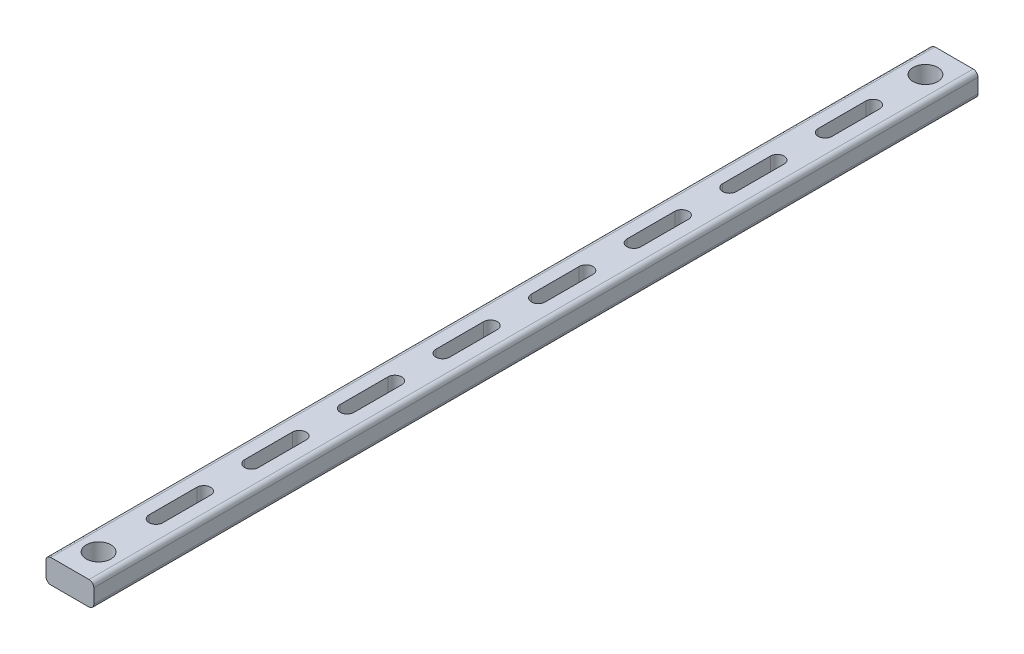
ISO-10303-21;
HEADER;
FILE_DESCRIPTION(('STEP AP214'),'2;1');
FILE_NAME('part.step','',(''),(''),'','','');
FILE_SCHEMA(('AUTOMOTIVE_DESIGN { 1 0 10303 214 1 1 1 1 }'));
ENDSEC;
DATA;
#1=APPLICATION_CONTEXT('core data for automotive mechanical design processes');
#2=APPLICATION_PROTOCOL_DEFINITION('international standard','automotive_design',2000,#1);
#3=PRODUCT_CONTEXT('',#1,'mechanical');
#4=PRODUCT('Part','Part','',(#3));
#5=PRODUCT_RELATED_PRODUCT_CATEGORY('part','',(#4));
#6=PRODUCT_DEFINITION_FORMATION('','',#4);
#7=PRODUCT_DEFINITION_CONTEXT('part definition',#1,'design');
#8=PRODUCT_DEFINITION('design','',#6,#7);
#9=PRODUCT_DEFINITION_SHAPE('','',#8);
#10=(LENGTH_UNIT() NAMED_UNIT(*) SI_UNIT(.MILLI.,.METRE.));
#11=(NAMED_UNIT(*) PLANE_ANGLE_UNIT() SI_UNIT($,.RADIAN.));
#12=(NAMED_UNIT(*) SI_UNIT($,.STERADIAN.) SOLID_ANGLE_UNIT());
#13=UNCERTAINTY_MEASURE_WITH_UNIT(LENGTH_MEASURE(1.E-05),#10,'distance_accuracy_value','');
#14=(GEOMETRIC_REPRESENTATION_CONTEXT(3) GLOBAL_UNCERTAINTY_ASSIGNED_CONTEXT((#13)) GLOBAL_UNIT_ASSIGNED_CONTEXT((#10,
#11,#12)) REPRESENTATION_CONTEXT('',''));
#15=CARTESIAN_POINT('',(0.,0.,0.));
#16=DIRECTION('',(0.,0.,1.));
#17=DIRECTION('',(1.,0.,0.));
#18=AXIS2_PLACEMENT_3D('',#15,#16,#17);
#19=CARTESIAN_POINT('',(0.9144,-1.5875,-41.5925));
#20=DIRECTION('',(1.,0.,0.));
#21=DIRECTION('',(0.,0.,-1.));
#22=AXIS2_PLACEMENT_3D('',#19,#20,#21);
#23=PLANE('',#22);
#24=DIRECTION('',(0.,0.,-1.));
#25=VECTOR('',#24,1.);
#26=CARTESIAN_POINT('',(0.9144,1.5875,-41.5925));
#27=LINE('',#26,#25);
#28=CARTESIAN_POINT('',(0.9144,1.5875,-41.5925));
#29=VERTEX_POINT('',#28);
#30=CARTESIAN_POINT('',(0.9144,1.5875,-47.9425));
#31=VERTEX_POINT('',#30);
#32=EDGE_CURVE('E636',#29,#31,#27,.T.);
#33=ORIENTED_EDGE('',*,*,#32,.T.);
#34=DIRECTION('',(0.,1.,0.));
#35=VECTOR('',#34,1.);
#36=CARTESIAN_POINT('',(0.9144,-1.5875,-47.9425));
#37=LINE('',#36,#35);
#38=CARTESIAN_POINT('',(0.9144,-1.5875,-47.9425));
#39=VERTEX_POINT('',#38);
#40=EDGE_CURVE('E11',#39,#31,#37,.T.);
#41=ORIENTED_EDGE('',*,*,#40,.F.);
#42=DIRECTION('',(0.,0.,-1.));
#43=VECTOR('',#42,1.);
#44=CARTESIAN_POINT('',(0.9144,-1.5875,-41.5925));
#45=LINE('',#44,#43);
#46=CARTESIAN_POINT('',(0.9144,-1.5875,-41.5925));
#47=VERTEX_POINT('',#46);
#48=EDGE_CURVE('E640',#47,#39,#45,.T.);
#49=ORIENTED_EDGE('',*,*,#48,.F.);
#50=DIRECTION('',(0.,1.,0.));
#51=VECTOR('',#50,1.);
#52=CARTESIAN_POINT('',(0.9144,-1.5875,-41.5925));
#53=LINE('',#52,#51);
#54=EDGE_CURVE('E645',#47,#29,#53,.T.);
#55=ORIENTED_EDGE('',*,*,#54,.T.);
#56=EDGE_LOOP('',(#33,#41,#49,#55));
#57=FACE_BOUND('',#56,.T.);
#58=ADVANCED_FACE('F40',(#57),#23,.F.);
#59=CARTESIAN_POINT('',(0.,-1.5875,-47.9425));
#60=DIRECTION('',(0.,1.,0.));
#61=DIRECTION('',(0.,0.,1.));
#62=AXIS2_PLACEMENT_3D('',#59,#60,#61);
#63=CYLINDRICAL_SURFACE('',#62,0.9144);
#64=CARTESIAN_POINT('',(0.,1.5875,-47.9425));
#65=DIRECTION('',(0.,1.,0.));
#66=DIRECTION('',(0.,0.,1.));
#67=AXIS2_PLACEMENT_3D('',#64,#65,#66);
#68=CIRCLE('',#67,0.9144);
#69=CARTESIAN_POINT('',(-0.9144,1.5875,-47.9425));
#70=VERTEX_POINT('',#69);
#71=EDGE_CURVE('E633',#31,#70,#68,.T.);
#72=ORIENTED_EDGE('',*,*,#71,.T.);
#73=DIRECTION('',(0.,1.,0.));
#74=VECTOR('',#73,1.);
#75=CARTESIAN_POINT('',(-0.9144,-1.5875,-47.9425));
#76=LINE('',#75,#74);
#77=CARTESIAN_POINT('',(-0.9144,-1.5875,-47.9425));
#78=VERTEX_POINT('',#77);
#79=EDGE_CURVE('E47',#78,#70,#76,.T.);
#80=ORIENTED_EDGE('',*,*,#79,.F.);
#81=CARTESIAN_POINT('',(0.,-1.5875,-47.9425));
#82=DIRECTION('',(0.,1.,0.));
#83=DIRECTION('',(0.,0.,1.));
#84=AXIS2_PLACEMENT_3D('',#81,#82,#83);
#85=CIRCLE('',#84,0.9144);
#86=EDGE_CURVE('E61',#39,#78,#85,.T.);
#87=ORIENTED_EDGE('',*,*,#86,.F.);
#88=ORIENTED_EDGE('',*,*,#40,.T.);
#89=EDGE_LOOP('',(#72,#80,#87,#88));
#90=FACE_BOUND('',#89,.T.);
#91=ADVANCED_FACE('F655',(#90),#63,.F.);
#92=CARTESIAN_POINT('',(-0.9144,-1.5875,-41.5925));
#93=DIRECTION('',(-1.,0.,0.));
#94=DIRECTION('',(0.,0.,1.));
#95=AXIS2_PLACEMENT_3D('',#92,#93,#94);
#96=PLANE('',#95);
#97=DIRECTION('',(0.,0.,1.));
#98=VECTOR('',#97,1.);
#99=CARTESIAN_POINT('',(-0.9144,1.5875,-41.5925));
#100=LINE('',#99,#98);
#101=CARTESIAN_POINT('',(-0.9144,1.5875,-41.5925));
#102=VERTEX_POINT('',#101);
#103=EDGE_CURVE('E630',#70,#102,#100,.T.);
#104=ORIENTED_EDGE('',*,*,#103,.T.);
#105=DIRECTION('',(0.,1.,0.));
#106=VECTOR('',#105,1.);
#107=CARTESIAN_POINT('',(-0.9144,-1.5875,-41.5925));
#108=LINE('',#107,#106);
#109=CARTESIAN_POINT('',(-0.9144,-1.5875,-41.5925));
#110=VERTEX_POINT('',#109);
#111=EDGE_CURVE('E648',#110,#102,#108,.T.);
#112=ORIENTED_EDGE('',*,*,#111,.F.);
#113=DIRECTION('',(0.,0.,1.));
#114=VECTOR('',#113,1.);
#115=CARTESIAN_POINT('',(-0.9144,-1.5875,-41.5925));
#116=LINE('',#115,#114);
#117=EDGE_CURVE('E643',#78,#110,#116,.T.);
#118=ORIENTED_EDGE('',*,*,#117,.F.);
#119=ORIENTED_EDGE('',*,*,#79,.T.);
#120=EDGE_LOOP('',(#104,#112,#118,#119));
#121=FACE_BOUND('',#120,.T.);
#122=ADVANCED_FACE('F652',(#121),#96,.F.);
#123=CARTESIAN_POINT('',(0.,-1.5875,-41.5925));
#124=DIRECTION('',(0.,1.,0.));
#125=DIRECTION('',(0.,0.,1.));
#126=AXIS2_PLACEMENT_3D('',#123,#124,#125);
#127=CYLINDRICAL_SURFACE('',#126,0.9144);
#128=CARTESIAN_POINT('',(0.,1.5875,-41.5925));
#129=DIRECTION('',(0.,1.,0.));
#130=DIRECTION('',(0.,0.,1.));
#131=AXIS2_PLACEMENT_3D('',#128,#129,#130);
#132=CIRCLE('',#131,0.9144);
#133=EDGE_CURVE('E628',#102,#29,#132,.T.);
#134=ORIENTED_EDGE('',*,*,#133,.T.);
#135=ORIENTED_EDGE('',*,*,#54,.F.);
#136=CARTESIAN_POINT('',(0.,-1.5875,-41.5925));
#137=DIRECTION('',(0.,1.,0.));
#138=DIRECTION('',(0.,0.,1.));
#139=AXIS2_PLACEMENT_3D('',#136,#137,#138);
#140=CIRCLE('',#139,0.9144);
#141=EDGE_CURVE('E54',#110,#47,#140,.T.);
#142=ORIENTED_EDGE('',*,*,#141,.F.);
#143=ORIENTED_EDGE('',*,*,#111,.T.);
#144=EDGE_LOOP('',(#134,#135,#142,#143));
#145=FACE_BOUND('',#144,.T.);
#146=ADVANCED_FACE('F661',(#145),#127,.F.);
#147=CARTESIAN_POINT('',(0.9144,-1.5875,-28.8925));
#148=DIRECTION('',(1.,0.,0.));
#149=DIRECTION('',(0.,0.,-1.));
#150=AXIS2_PLACEMENT_3D('',#147,#148,#149);
#151=PLANE('',#150);
#152=DIRECTION('',(0.,0.,-1.));
#153=VECTOR('',#152,1.);
#154=CARTESIAN_POINT('',(0.9144,1.5875,-28.8925));
#155=LINE('',#154,#153);
#156=CARTESIAN_POINT('',(0.9144,1.5875,-28.8925));
#157=VERTEX_POINT('',#156);
#158=CARTESIAN_POINT('',(0.9144,1.5875,-35.2425));
#159=VERTEX_POINT('',#158);
#160=EDGE_CURVE('E604',#157,#159,#155,.T.);
#161=ORIENTED_EDGE('',*,*,#160,.T.);
#162=DIRECTION('',(0.,1.,0.));
#163=VECTOR('',#162,1.);
#164=CARTESIAN_POINT('',(0.9144,-1.5875,-35.2425));
#165=LINE('',#164,#163);
#166=CARTESIAN_POINT('',(0.9144,-1.5875,-35.2425));
#167=VERTEX_POINT('',#166);
#168=EDGE_CURVE('E625',#167,#159,#165,.T.);
#169=ORIENTED_EDGE('',*,*,#168,.F.);
#170=DIRECTION('',(0.,0.,-1.));
#171=VECTOR('',#170,1.);
#172=CARTESIAN_POINT('',(0.9144,-1.5875,-28.8925));
#173=LINE('',#172,#171);
#174=CARTESIAN_POINT('',(0.9144,-1.5875,-28.8925));
#175=VERTEX_POINT('',#174);
#176=EDGE_CURVE('E609',#175,#167,#173,.T.);
#177=ORIENTED_EDGE('',*,*,#176,.F.);
#178=DIRECTION('',(0.,1.,0.));
#179=VECTOR('',#178,1.);
#180=CARTESIAN_POINT('',(0.9144,-1.5875,-28.8925));
#181=LINE('',#180,#179);
#182=EDGE_CURVE('E616',#175,#157,#181,.T.);
#183=ORIENTED_EDGE('',*,*,#182,.T.);
#184=EDGE_LOOP('',(#161,#169,#177,#183));
#185=FACE_BOUND('',#184,.T.);
#186=ADVANCED_FACE('F663',(#185),#151,.F.);
#187=CARTESIAN_POINT('',(0.,-1.5875,-35.2425));
#188=DIRECTION('',(0.,1.,0.));
#189=DIRECTION('',(0.,0.,1.));
#190=AXIS2_PLACEMENT_3D('',#187,#188,#189);
#191=CYLINDRICAL_SURFACE('',#190,0.9144);
#192=CARTESIAN_POINT('',(0.,1.5875,-35.2425));
#193=DIRECTION('',(0.,1.,0.));
#194=DIRECTION('',(0.,0.,1.));
#195=AXIS2_PLACEMENT_3D('',#192,#193,#194);
#196=CIRCLE('',#195,0.9144);
#197=CARTESIAN_POINT('',(-0.9144,1.5875,-35.2425));
#198=VERTEX_POINT('',#197);
#199=EDGE_CURVE('E601',#159,#198,#196,.T.);
#200=ORIENTED_EDGE('',*,*,#199,.T.);
#201=DIRECTION('',(0.,1.,0.));
#202=VECTOR('',#201,1.);
#203=CARTESIAN_POINT('',(-0.9144,-1.5875,-35.2425));
#204=LINE('',#203,#202);
#205=CARTESIAN_POINT('',(-0.9144,-1.5875,-35.2425));
#206=VERTEX_POINT('',#205);
#207=EDGE_CURVE('E622',#206,#198,#204,.T.);
#208=ORIENTED_EDGE('',*,*,#207,.F.);
#209=CARTESIAN_POINT('',(0.,-1.5875,-35.2425));
#210=DIRECTION('',(0.,1.,0.));
#211=DIRECTION('',(0.,0.,1.));
#212=AXIS2_PLACEMENT_3D('',#209,#210,#211);
#213=CIRCLE('',#212,0.9144);
#214=EDGE_CURVE('E611',#167,#206,#213,.T.);
#215=ORIENTED_EDGE('',*,*,#214,.F.);
#216=ORIENTED_EDGE('',*,*,#168,.T.);
#217=EDGE_LOOP('',(#200,#208,#215,#216));
#218=FACE_BOUND('',#217,.T.);
#219=ADVANCED_FACE('F669',(#218),#191,.F.);
#220=CARTESIAN_POINT('',(-0.9144,-1.5875,-28.8925));
#221=DIRECTION('',(-1.,0.,0.));
#222=DIRECTION('',(0.,0.,1.));
#223=AXIS2_PLACEMENT_3D('',#220,#221,#222);
#224=PLANE('',#223);
#225=DIRECTION('',(0.,0.,1.));
#226=VECTOR('',#225,1.);
#227=CARTESIAN_POINT('',(-0.9144,1.5875,-28.8925));
#228=LINE('',#227,#226);
#229=CARTESIAN_POINT('',(-0.9144,1.5875,-28.8925));
#230=VERTEX_POINT('',#229);
#231=EDGE_CURVE('E598',#198,#230,#228,.T.);
#232=ORIENTED_EDGE('',*,*,#231,.T.);
#233=DIRECTION('',(0.,1.,0.));
#234=VECTOR('',#233,1.);
#235=CARTESIAN_POINT('',(-0.9144,-1.5875,-28.8925));
#236=LINE('',#235,#234);
#237=CARTESIAN_POINT('',(-0.9144,-1.5875,-28.8925));
#238=VERTEX_POINT('',#237);
#239=EDGE_CURVE('E619',#238,#230,#236,.T.);
#240=ORIENTED_EDGE('',*,*,#239,.F.);
#241=DIRECTION('',(0.,0.,1.));
#242=VECTOR('',#241,1.);
#243=CARTESIAN_POINT('',(-0.9144,-1.5875,-28.8925));
#244=LINE('',#243,#242);
#245=EDGE_CURVE('E613',#206,#238,#244,.T.);
#246=ORIENTED_EDGE('',*,*,#245,.F.);
#247=ORIENTED_EDGE('',*,*,#207,.T.);
#248=EDGE_LOOP('',(#232,#240,#246,#247));
#249=FACE_BOUND('',#248,.T.);
#250=ADVANCED_FACE('F702',(#249),#224,.F.);
#251=CARTESIAN_POINT('',(0.,-1.5875,-28.8925));
#252=DIRECTION('',(0.,1.,0.));
#253=DIRECTION('',(0.,0.,1.));
#254=AXIS2_PLACEMENT_3D('',#251,#252,#253);
#255=CYLINDRICAL_SURFACE('',#254,0.9144);
#256=CARTESIAN_POINT('',(0.,1.5875,-28.8925));
#257=DIRECTION('',(0.,1.,0.));
#258=DIRECTION('',(0.,0.,1.));
#259=AXIS2_PLACEMENT_3D('',#256,#257,#258);
#260=CIRCLE('',#259,0.9144);
#261=EDGE_CURVE('E596',#230,#157,#260,.T.);
#262=ORIENTED_EDGE('',*,*,#261,.T.);
#263=ORIENTED_EDGE('',*,*,#182,.F.);
#264=CARTESIAN_POINT('',(0.,-1.5875,-28.8925));
#265=DIRECTION('',(0.,1.,0.));
#266=DIRECTION('',(0.,0.,1.));
#267=AXIS2_PLACEMENT_3D('',#264,#265,#266);
#268=CIRCLE('',#267,0.9144);
#269=EDGE_CURVE('E607',#238,#175,#268,.T.);
#270=ORIENTED_EDGE('',*,*,#269,.F.);
#271=ORIENTED_EDGE('',*,*,#239,.T.);
#272=EDGE_LOOP('',(#262,#263,#270,#271));
#273=FACE_BOUND('',#272,.T.);
#274=ADVANCED_FACE('F712',(#273),#255,.F.);
#275=CARTESIAN_POINT('',(0.9144,-1.5875,-16.1925));
#276=DIRECTION('',(1.,0.,0.));
#277=DIRECTION('',(0.,0.,-1.));
#278=AXIS2_PLACEMENT_3D('',#275,#276,#277);
#279=PLANE('',#278);
#280=DIRECTION('',(0.,0.,-1.));
#281=VECTOR('',#280,1.);
#282=CARTESIAN_POINT('',(0.9144,1.5875,-16.1925));
#283=LINE('',#282,#281);
#284=CARTESIAN_POINT('',(0.9144,1.5875,-16.1925));
#285=VERTEX_POINT('',#284);
#286=CARTESIAN_POINT('',(0.9144,1.5875,-22.5425));
#287=VERTEX_POINT('',#286);
#288=EDGE_CURVE('E572',#285,#287,#283,.T.);
#289=ORIENTED_EDGE('',*,*,#288,.T.);
#290=DIRECTION('',(0.,1.,0.));
#291=VECTOR('',#290,1.);
#292=CARTESIAN_POINT('',(0.9144,-1.5875,-22.5425));
#293=LINE('',#292,#291);
#294=CARTESIAN_POINT('',(0.9144,-1.5875,-22.5425));
#295=VERTEX_POINT('',#294);
#296=EDGE_CURVE('E593',#295,#287,#293,.T.);
#297=ORIENTED_EDGE('',*,*,#296,.F.);
#298=DIRECTION('',(0.,0.,-1.));
#299=VECTOR('',#298,1.);
#300=CARTESIAN_POINT('',(0.9144,-1.5875,-16.1925));
#301=LINE('',#300,#299);
#302=CARTESIAN_POINT('',(0.9144,-1.5875,-16.1925));
#303=VERTEX_POINT('',#302);
#304=EDGE_CURVE('E577',#303,#295,#301,.T.);
#305=ORIENTED_EDGE('',*,*,#304,.F.);
#306=DIRECTION('',(0.,1.,0.));
#307=VECTOR('',#306,1.);
#308=CARTESIAN_POINT('',(0.9144,-1.5875,-16.1925));
#309=LINE('',#308,#307);
#310=EDGE_CURVE('E584',#303,#285,#309,.T.);
#311=ORIENTED_EDGE('',*,*,#310,.T.);
#312=EDGE_LOOP('',(#289,#297,#305,#311));
#313=FACE_BOUND('',#312,.T.);
#314=ADVANCED_FACE('F722',(#313),#279,.F.);
#315=CARTESIAN_POINT('',(0.,-1.5875,-22.5425));
#316=DIRECTION('',(0.,1.,0.));
#317=DIRECTION('',(0.,0.,1.));
#318=AXIS2_PLACEMENT_3D('',#315,#316,#317);
#319=CYLINDRICAL_SURFACE('',#318,0.9144);
#320=CARTESIAN_POINT('',(0.,1.5875,-22.5425));
#321=DIRECTION('',(0.,1.,0.));
#322=DIRECTION('',(0.,0.,1.));
#323=AXIS2_PLACEMENT_3D('',#320,#321,#322);
#324=CIRCLE('',#323,0.9144);
#325=CARTESIAN_POINT('',(-0.9144,1.5875,-22.5425));
#326=VERTEX_POINT('',#325);
#327=EDGE_CURVE('E569',#287,#326,#324,.T.);
#328=ORIENTED_EDGE('',*,*,#327,.T.);
#329=DIRECTION('',(0.,1.,0.));
#330=VECTOR('',#329,1.);
#331=CARTESIAN_POINT('',(-0.9144,-1.5875,-22.5425));
#332=LINE('',#331,#330);
#333=CARTESIAN_POINT('',(-0.9144,-1.5875,-22.5425));
#334=VERTEX_POINT('',#333);
#335=EDGE_CURVE('E590',#334,#326,#332,.T.);
#336=ORIENTED_EDGE('',*,*,#335,.F.);
#337=CARTESIAN_POINT('',(0.,-1.5875,-22.5425));
#338=DIRECTION('',(0.,1.,0.));
#339=DIRECTION('',(0.,0.,1.));
#340=AXIS2_PLACEMENT_3D('',#337,#338,#339);
#341=CIRCLE('',#340,0.9144);
#342=EDGE_CURVE('E579',#295,#334,#341,.T.);
#343=ORIENTED_EDGE('',*,*,#342,.F.);
#344=ORIENTED_EDGE('',*,*,#296,.T.);
#345=EDGE_LOOP('',(#328,#336,#343,#344));
#346=FACE_BOUND('',#345,.T.);
#347=ADVANCED_FACE('F732',(#346),#319,.F.);
#348=CARTESIAN_POINT('',(-0.9144,-1.5875,-16.1925));
#349=DIRECTION('',(-1.,0.,0.));
#350=DIRECTION('',(0.,0.,1.));
#351=AXIS2_PLACEMENT_3D('',#348,#349,#350);
#352=PLANE('',#351);
#353=DIRECTION('',(0.,0.,1.));
#354=VECTOR('',#353,1.);
#355=CARTESIAN_POINT('',(-0.9144,1.5875,-16.1925));
#356=LINE('',#355,#354);
#357=CARTESIAN_POINT('',(-0.9144,1.5875,-16.1925));
#358=VERTEX_POINT('',#357);
#359=EDGE_CURVE('E566',#326,#358,#356,.T.);
#360=ORIENTED_EDGE('',*,*,#359,.T.);
#361=DIRECTION('',(0.,1.,0.));
#362=VECTOR('',#361,1.);
#363=CARTESIAN_POINT('',(-0.9144,-1.5875,-16.1925));
#364=LINE('',#363,#362);
#365=CARTESIAN_POINT('',(-0.9144,-1.5875,-16.1925));
#366=VERTEX_POINT('',#365);
#367=EDGE_CURVE('E587',#366,#358,#364,.T.);
#368=ORIENTED_EDGE('',*,*,#367,.F.);
#369=DIRECTION('',(0.,0.,1.));
#370=VECTOR('',#369,1.);
#371=CARTESIAN_POINT('',(-0.9144,-1.5875,-16.1925));
#372=LINE('',#371,#370);
#373=EDGE_CURVE('E581',#334,#366,#372,.T.);
#374=ORIENTED_EDGE('',*,*,#373,.F.);
#375=ORIENTED_EDGE('',*,*,#335,.T.);
#376=EDGE_LOOP('',(#360,#368,#374,#375));
#377=FACE_BOUND('',#376,.T.);
#378=ADVANCED_FACE('F742',(#377),#352,.F.);
#379=CARTESIAN_POINT('',(0.,-1.5875,-16.1925));
#380=DIRECTION('',(0.,1.,0.));
#381=DIRECTION('',(0.,0.,1.));
#382=AXIS2_PLACEMENT_3D('',#379,#380,#381);
#383=CYLINDRICAL_SURFACE('',#382,0.9144);
#384=CARTESIAN_POINT('',(0.,1.5875,-16.1925));
#385=DIRECTION('',(0.,1.,0.));
#386=DIRECTION('',(0.,0.,1.));
#387=AXIS2_PLACEMENT_3D('',#384,#385,#386);
#388=CIRCLE('',#387,0.9144);
#389=EDGE_CURVE('E564',#358,#285,#388,.T.);
#390=ORIENTED_EDGE('',*,*,#389,.T.);
#391=ORIENTED_EDGE('',*,*,#310,.F.);
#392=CARTESIAN_POINT('',(0.,-1.5875,-16.1925));
#393=DIRECTION('',(0.,1.,0.));
#394=DIRECTION('',(0.,0.,1.));
#395=AXIS2_PLACEMENT_3D('',#392,#393,#394);
#396=CIRCLE('',#395,0.9144);
#397=EDGE_CURVE('E575',#366,#303,#396,.T.);
#398=ORIENTED_EDGE('',*,*,#397,.F.);
#399=ORIENTED_EDGE('',*,*,#367,.T.);
#400=EDGE_LOOP('',(#390,#391,#398,#399));
#401=FACE_BOUND('',#400,.T.);
#402=ADVANCED_FACE('F752',(#401),#383,.F.);
#403=CARTESIAN_POINT('',(0.9144,-1.5875,-3.4925));
#404=DIRECTION('',(1.,0.,0.));
#405=DIRECTION('',(0.,0.,-1.));
#406=AXIS2_PLACEMENT_3D('',#403,#404,#405);
#407=PLANE('',#406);
#408=DIRECTION('',(0.,0.,-1.));
#409=VECTOR('',#408,1.);
#410=CARTESIAN_POINT('',(0.9144,1.5875,-3.4925));
#411=LINE('',#410,#409);
#412=CARTESIAN_POINT('',(0.9144,1.5875,-3.4925));
#413=VERTEX_POINT('',#412);
#414=CARTESIAN_POINT('',(0.9144,1.5875,-9.8425));
#415=VERTEX_POINT('',#414);
#416=EDGE_CURVE('E540',#413,#415,#411,.T.);
#417=ORIENTED_EDGE('',*,*,#416,.T.);
#418=DIRECTION('',(0.,1.,0.));
#419=VECTOR('',#418,1.);
#420=CARTESIAN_POINT('',(0.9144,-1.5875,-9.8425));
#421=LINE('',#420,#419);
#422=CARTESIAN_POINT('',(0.9144,-1.5875,-9.8425));
#423=VERTEX_POINT('',#422);
#424=EDGE_CURVE('E561',#423,#415,#421,.T.);
#425=ORIENTED_EDGE('',*,*,#424,.F.);
#426=DIRECTION('',(0.,0.,-1.));
#427=VECTOR('',#426,1.);
#428=CARTESIAN_POINT('',(0.9144,-1.5875,-3.4925));
#429=LINE('',#428,#427);
#430=CARTESIAN_POINT('',(0.9144,-1.5875,-3.4925));
#431=VERTEX_POINT('',#430);
#432=EDGE_CURVE('E545',#431,#423,#429,.T.);
#433=ORIENTED_EDGE('',*,*,#432,.F.);
#434=DIRECTION('',(0.,1.,0.));
#435=VECTOR('',#434,1.);
#436=CARTESIAN_POINT('',(0.9144,-1.5875,-3.4925));
#437=LINE('',#436,#435);
#438=EDGE_CURVE('E552',#431,#413,#437,.T.);
#439=ORIENTED_EDGE('',*,*,#438,.T.);
#440=EDGE_LOOP('',(#417,#425,#433,#439));
#441=FACE_BOUND('',#440,.T.);
#442=ADVANCED_FACE('F762',(#441),#407,.F.);
#443=CARTESIAN_POINT('',(0.,-1.5875,-9.8425));
#444=DIRECTION('',(0.,1.,0.));
#445=DIRECTION('',(0.,0.,1.));
#446=AXIS2_PLACEMENT_3D('',#443,#444,#445);
#447=CYLINDRICAL_SURFACE('',#446,0.9144);
#448=CARTESIAN_POINT('',(0.,1.5875,-9.8425));
#449=DIRECTION('',(0.,1.,0.));
#450=DIRECTION('',(0.,0.,1.));
#451=AXIS2_PLACEMENT_3D('',#448,#449,#450);
#452=CIRCLE('',#451,0.9144);
#453=CARTESIAN_POINT('',(-0.9144,1.5875,-9.8425));
#454=VERTEX_POINT('',#453);
#455=EDGE_CURVE('E537',#415,#454,#452,.T.);
#456=ORIENTED_EDGE('',*,*,#455,.T.);
#457=DIRECTION('',(0.,1.,0.));
#458=VECTOR('',#457,1.);
#459=CARTESIAN_POINT('',(-0.9144,-1.5875,-9.8425));
#460=LINE('',#459,#458);
#461=CARTESIAN_POINT('',(-0.9144,-1.5875,-9.8425));
#462=VERTEX_POINT('',#461);
#463=EDGE_CURVE('E558',#462,#454,#460,.T.);
#464=ORIENTED_EDGE('',*,*,#463,.F.);
#465=CARTESIAN_POINT('',(0.,-1.5875,-9.8425));
#466=DIRECTION('',(0.,1.,0.));
#467=DIRECTION('',(0.,0.,1.));
#468=AXIS2_PLACEMENT_3D('',#465,#466,#467);
#469=CIRCLE('',#468,0.9144);
#470=EDGE_CURVE('E547',#423,#462,#469,.T.);
#471=ORIENTED_EDGE('',*,*,#470,.F.);
#472=ORIENTED_EDGE('',*,*,#424,.T.);
#473=EDGE_LOOP('',(#456,#464,#471,#472));
#474=FACE_BOUND('',#473,.T.);
#475=ADVANCED_FACE('F772',(#474),#447,.F.);
#476=CARTESIAN_POINT('',(-0.9144,-1.5875,-3.4925));
#477=DIRECTION('',(-1.,0.,0.));
#478=DIRECTION('',(0.,0.,1.));
#479=AXIS2_PLACEMENT_3D('',#476,#477,#478);
#480=PLANE('',#479);
#481=DIRECTION('',(0.,0.,1.));
#482=VECTOR('',#481,1.);
#483=CARTESIAN_POINT('',(-0.9144,1.5875,-3.4925));
#484=LINE('',#483,#482);
#485=CARTESIAN_POINT('',(-0.9144,1.5875,-3.4925));
#486=VERTEX_POINT('',#485);
#487=EDGE_CURVE('E534',#454,#486,#484,.T.);
#488=ORIENTED_EDGE('',*,*,#487,.T.);
#489=DIRECTION('',(0.,1.,0.));
#490=VECTOR('',#489,1.);
#491=CARTESIAN_POINT('',(-0.9144,-1.5875,-3.4925));
#492=LINE('',#491,#490);
#493=CARTESIAN_POINT('',(-0.9144,-1.5875,-3.4925));
#494=VERTEX_POINT('',#493);
#495=EDGE_CURVE('E555',#494,#486,#492,.T.);
#496=ORIENTED_EDGE('',*,*,#495,.F.);
#497=DIRECTION('',(0.,0.,1.));
#498=VECTOR('',#497,1.);
#499=CARTESIAN_POINT('',(-0.9144,-1.5875,-3.4925));
#500=LINE('',#499,#498);
#501=EDGE_CURVE('E549',#462,#494,#500,.T.);
#502=ORIENTED_EDGE('',*,*,#501,.F.);
#503=ORIENTED_EDGE('',*,*,#463,.T.);
#504=EDGE_LOOP('',(#488,#496,#502,#503));
#505=FACE_BOUND('',#504,.T.);
#506=ADVANCED_FACE('F782',(#505),#480,.F.);
#507=CARTESIAN_POINT('',(0.,-1.5875,-3.4925));
#508=DIRECTION('',(0.,1.,0.));
#509=DIRECTION('',(0.,0.,1.));
#510=AXIS2_PLACEMENT_3D('',#507,#508,#509);
#511=CYLINDRICAL_SURFACE('',#510,0.9144);
#512=CARTESIAN_POINT('',(0.,1.5875,-3.4925));
#513=DIRECTION('',(0.,1.,0.));
#514=DIRECTION('',(0.,0.,1.));
#515=AXIS2_PLACEMENT_3D('',#512,#513,#514);
#516=CIRCLE('',#515,0.9144);
#517=EDGE_CURVE('E532',#486,#413,#516,.T.);
#518=ORIENTED_EDGE('',*,*,#517,.T.);
#519=ORIENTED_EDGE('',*,*,#438,.F.);
#520=CARTESIAN_POINT('',(0.,-1.5875,-3.4925));
#521=DIRECTION('',(0.,1.,0.));
#522=DIRECTION('',(0.,0.,1.));
#523=AXIS2_PLACEMENT_3D('',#520,#521,#522);
#524=CIRCLE('',#523,0.9144);
#525=EDGE_CURVE('E543',#494,#431,#524,.T.);
#526=ORIENTED_EDGE('',*,*,#525,.F.);
#527=ORIENTED_EDGE('',*,*,#495,.T.);
#528=EDGE_LOOP('',(#518,#519,#526,#527));
#529=FACE_BOUND('',#528,.T.);
#530=ADVANCED_FACE('F792',(#529),#511,.F.);
#531=CARTESIAN_POINT('',(0.9144,-1.5875,9.2075));
#532=DIRECTION('',(1.,0.,0.));
#533=DIRECTION('',(0.,0.,-1.));
#534=AXIS2_PLACEMENT_3D('',#531,#532,#533);
#535=PLANE('',#534);
#536=DIRECTION('',(0.,0.,-1.));
#537=VECTOR('',#536,1.);
#538=CARTESIAN_POINT('',(0.9144,1.5875,9.2075));
#539=LINE('',#538,#537);
#540=CARTESIAN_POINT('',(0.9144,1.5875,9.2075));
#541=VERTEX_POINT('',#540);
#542=CARTESIAN_POINT('',(0.9144,1.5875,2.8575));
#543=VERTEX_POINT('',#542);
#544=EDGE_CURVE('E499',#541,#543,#539,.T.);
#545=ORIENTED_EDGE('',*,*,#544,.T.);
#546=DIRECTION('',(0.,1.,0.));
#547=VECTOR('',#546,1.);
#548=CARTESIAN_POINT('',(0.9144,-1.5875,2.8575));
#549=LINE('',#548,#547);
#550=CARTESIAN_POINT('',(0.9144,-1.5875,2.8575));
#551=VERTEX_POINT('',#550);
#552=EDGE_CURVE('E528',#551,#543,#549,.T.);
#553=ORIENTED_EDGE('',*,*,#552,.F.);
#554=DIRECTION('',(0.,0.,-1.));
#555=VECTOR('',#554,1.);
#556=CARTESIAN_POINT('',(0.9144,-1.5875,9.2075));
#557=LINE('',#556,#555);
#558=CARTESIAN_POINT('',(0.9144,-1.5875,9.2075));
#559=VERTEX_POINT('',#558);
#560=EDGE_CURVE('E506',#559,#551,#557,.T.);
#561=ORIENTED_EDGE('',*,*,#560,.F.);
#562=DIRECTION('',(0.,1.,0.));
#563=VECTOR('',#562,1.);
#564=CARTESIAN_POINT('',(0.9144,-1.5875,9.2075));
#565=LINE('',#564,#563);
#566=EDGE_CURVE('E516',#559,#541,#565,.T.);
#567=ORIENTED_EDGE('',*,*,#566,.T.);
#568=EDGE_LOOP('',(#545,#553,#561,#567));
#569=FACE_BOUND('',#568,.T.);
#570=ADVANCED_FACE('F802',(#569),#535,.F.);
#571=CARTESIAN_POINT('',(0.,-1.5875,2.8575));
#572=DIRECTION('',(0.,1.,0.));
#573=DIRECTION('',(0.,0.,1.));
#574=AXIS2_PLACEMENT_3D('',#571,#572,#573);
#575=CYLINDRICAL_SURFACE('',#574,0.9144);
#576=CARTESIAN_POINT('',(0.,1.5875,2.8575));
#577=DIRECTION('',(0.,1.,0.));
#578=DIRECTION('',(0.,0.,1.));
#579=AXIS2_PLACEMENT_3D('',#576,#577,#578);
#580=CIRCLE('',#579,0.9144);
#581=CARTESIAN_POINT('',(-0.9144,1.5875,2.8575));
#582=VERTEX_POINT('',#581);
#583=EDGE_CURVE('E495',#543,#582,#580,.T.);
#584=ORIENTED_EDGE('',*,*,#583,.T.);
#585=DIRECTION('',(0.,1.,0.));
#586=VECTOR('',#585,1.);
#587=CARTESIAN_POINT('',(-0.9144,-1.5875,2.8575));
#588=LINE('',#587,#586);
#589=CARTESIAN_POINT('',(-0.9144,-1.5875,2.8575));
#590=VERTEX_POINT('',#589);
#591=EDGE_CURVE('E524',#590,#582,#588,.T.);
#592=ORIENTED_EDGE('',*,*,#591,.F.);
#593=CARTESIAN_POINT('',(0.,-1.5875,2.8575));
#594=DIRECTION('',(0.,1.,0.));
#595=DIRECTION('',(0.,0.,1.));
#596=AXIS2_PLACEMENT_3D('',#593,#594,#595);
#597=CIRCLE('',#596,0.9144);
#598=EDGE_CURVE('E509',#551,#590,#597,.T.);
#599=ORIENTED_EDGE('',*,*,#598,.F.);
#600=ORIENTED_EDGE('',*,*,#552,.T.);
#601=EDGE_LOOP('',(#584,#592,#599,#600));
#602=FACE_BOUND('',#601,.T.);
#603=ADVANCED_FACE('F812',(#602),#575,.F.);
#604=CARTESIAN_POINT('',(-0.9144,-1.5875,9.2075));
#605=DIRECTION('',(-1.,0.,0.));
#606=DIRECTION('',(0.,0.,1.));
#607=AXIS2_PLACEMENT_3D('',#604,#605,#606);
#608=PLANE('',#607);
#609=DIRECTION('',(0.,0.,1.));
#610=VECTOR('',#609,1.);
#611=CARTESIAN_POINT('',(-0.9144,1.5875,9.2075));
#612=LINE('',#611,#610);
#613=CARTESIAN_POINT('',(-0.9144,1.5875,9.2075));
#614=VERTEX_POINT('',#613);
#615=EDGE_CURVE('E491',#582,#614,#612,.T.);
#616=ORIENTED_EDGE('',*,*,#615,.T.);
#617=DIRECTION('',(0.,1.,0.));
#618=VECTOR('',#617,1.);
#619=CARTESIAN_POINT('',(-0.9144,-1.5875,9.2075));
#620=LINE('',#619,#618);
#621=CARTESIAN_POINT('',(-0.9144,-1.5875,9.2075));
#622=VERTEX_POINT('',#621);
#623=EDGE_CURVE('E520',#622,#614,#620,.T.);
#624=ORIENTED_EDGE('',*,*,#623,.F.);
#625=DIRECTION('',(0.,0.,1.));
#626=VECTOR('',#625,1.);
#627=CARTESIAN_POINT('',(-0.9144,-1.5875,9.2075));
#628=LINE('',#627,#626);
#629=EDGE_CURVE('E512',#590,#622,#628,.T.);
#630=ORIENTED_EDGE('',*,*,#629,.F.);
#631=ORIENTED_EDGE('',*,*,#591,.T.);
#632=EDGE_LOOP('',(#616,#624,#630,#631));
#633=FACE_BOUND('',#632,.T.);
#634=ADVANCED_FACE('F822',(#633),#608,.F.);
#635=CARTESIAN_POINT('',(0.,-1.5875,9.2075));
#636=DIRECTION('',(0.,1.,0.));
#637=DIRECTION('',(0.,0.,1.));
#638=AXIS2_PLACEMENT_3D('',#635,#636,#637);
#639=CYLINDRICAL_SURFACE('',#638,0.9144);
#640=CARTESIAN_POINT('',(0.,1.5875,9.2075));
#641=DIRECTION('',(0.,1.,0.));
#642=DIRECTION('',(0.,0.,1.));
#643=AXIS2_PLACEMENT_3D('',#640,#641,#642);
#644=CIRCLE('',#643,0.9144);
#645=EDGE_CURVE('E488',#614,#541,#644,.T.);
#646=ORIENTED_EDGE('',*,*,#645,.T.);
#647=ORIENTED_EDGE('',*,*,#566,.F.);
#648=CARTESIAN_POINT('',(0.,-1.5875,9.2075));
#649=DIRECTION('',(0.,1.,0.));
#650=DIRECTION('',(0.,0.,1.));
#651=AXIS2_PLACEMENT_3D('',#648,#649,#650);
#652=CIRCLE('',#651,0.9144);
#653=EDGE_CURVE('E503',#622,#559,#652,.T.);
#654=ORIENTED_EDGE('',*,*,#653,.F.);
#655=ORIENTED_EDGE('',*,*,#623,.T.);
#656=EDGE_LOOP('',(#646,#647,#654,#655));
#657=FACE_BOUND('',#656,.T.);
#658=ADVANCED_FACE('F832',(#657),#639,.F.);
#659=CARTESIAN_POINT('',(0.9144,-1.5875,21.9075));
#660=DIRECTION('',(1.,0.,0.));
#661=DIRECTION('',(0.,0.,-1.));
#662=AXIS2_PLACEMENT_3D('',#659,#660,#661);
#663=PLANE('',#662);
#664=DIRECTION('',(0.,0.,-1.));
#665=VECTOR('',#664,1.);
#666=CARTESIAN_POINT('',(0.9144,1.5875,21.9075));
#667=LINE('',#666,#665);
#668=CARTESIAN_POINT('',(0.9144,1.5875,21.9075));
#669=VERTEX_POINT('',#668);
#670=CARTESIAN_POINT('',(0.9144,1.5875,15.5575));
#671=VERTEX_POINT('',#670);
#672=EDGE_CURVE('E464',#669,#671,#667,.T.);
#673=ORIENTED_EDGE('',*,*,#672,.T.);
#674=DIRECTION('',(0.,1.,0.));
#675=VECTOR('',#674,1.);
#676=CARTESIAN_POINT('',(0.9144,-1.5875,15.5575));
#677=LINE('',#676,#675);
#678=CARTESIAN_POINT('',(0.9144,-1.5875,15.5575));
#679=VERTEX_POINT('',#678);
#680=EDGE_CURVE('E485',#679,#671,#677,.T.);
#681=ORIENTED_EDGE('',*,*,#680,.F.);
#682=DIRECTION('',(0.,0.,-1.));
#683=VECTOR('',#682,1.);
#684=CARTESIAN_POINT('',(0.9144,-1.5875,21.9075));
#685=LINE('',#684,#683);
#686=CARTESIAN_POINT('',(0.9144,-1.5875,21.9075));
#687=VERTEX_POINT('',#686);
#688=EDGE_CURVE('E469',#687,#679,#685,.T.);
#689=ORIENTED_EDGE('',*,*,#688,.F.);
#690=DIRECTION('',(0.,1.,0.));
#691=VECTOR('',#690,1.);
#692=CARTESIAN_POINT('',(0.9144,-1.5875,21.9075));
#693=LINE('',#692,#691);
#694=EDGE_CURVE('E476',#687,#669,#693,.T.);
#695=ORIENTED_EDGE('',*,*,#694,.T.);
#696=EDGE_LOOP('',(#673,#681,#689,#695));
#697=FACE_BOUND('',#696,.T.);
#698=ADVANCED_FACE('F842',(#697),#663,.F.);
#699=CARTESIAN_POINT('',(0.,-1.5875,15.5575));
#700=DIRECTION('',(0.,1.,0.));
#701=DIRECTION('',(0.,0.,1.));
#702=AXIS2_PLACEMENT_3D('',#699,#700,#701);
#703=CYLINDRICAL_SURFACE('',#702,0.9144);
#704=CARTESIAN_POINT('',(0.,1.5875,15.5575));
#705=DIRECTION('',(0.,1.,0.));
#706=DIRECTION('',(0.,0.,1.));
#707=AXIS2_PLACEMENT_3D('',#704,#705,#706);
#708=CIRCLE('',#707,0.9144);
#709=CARTESIAN_POINT('',(-0.9144,1.5875,15.5575));
#710=VERTEX_POINT('',#709);
#711=EDGE_CURVE('E461',#671,#710,#708,.T.);
#712=ORIENTED_EDGE('',*,*,#711,.T.);
#713=DIRECTION('',(0.,1.,0.));
#714=VECTOR('',#713,1.);
#715=CARTESIAN_POINT('',(-0.9144,-1.5875,15.5575));
#716=LINE('',#715,#714);
#717=CARTESIAN_POINT('',(-0.9144,-1.5875,15.5575));
#718=VERTEX_POINT('',#717);
#719=EDGE_CURVE('E482',#718,#710,#716,.T.);
#720=ORIENTED_EDGE('',*,*,#719,.F.);
#721=CARTESIAN_POINT('',(0.,-1.5875,15.5575));
#722=DIRECTION('',(0.,1.,0.));
#723=DIRECTION('',(0.,0.,1.));
#724=AXIS2_PLACEMENT_3D('',#721,#722,#723);
#725=CIRCLE('',#724,0.9144);
#726=EDGE_CURVE('E471',#679,#718,#725,.T.);
#727=ORIENTED_EDGE('',*,*,#726,.F.);
#728=ORIENTED_EDGE('',*,*,#680,.T.);
#729=EDGE_LOOP('',(#712,#720,#727,#728));
#730=FACE_BOUND('',#729,.T.);
#731=ADVANCED_FACE('F852',(#730),#703,.F.);
#732=CARTESIAN_POINT('',(-0.9144,-1.5875,21.9075));
#733=DIRECTION('',(-1.,0.,0.));
#734=DIRECTION('',(0.,0.,1.));
#735=AXIS2_PLACEMENT_3D('',#732,#733,#734);
#736=PLANE('',#735);
#737=DIRECTION('',(0.,0.,1.));
#738=VECTOR('',#737,1.);
#739=CARTESIAN_POINT('',(-0.9144,1.5875,21.9075));
#740=LINE('',#739,#738);
#741=CARTESIAN_POINT('',(-0.9144,1.5875,21.9075));
#742=VERTEX_POINT('',#741);
#743=EDGE_CURVE('E458',#710,#742,#740,.T.);
#744=ORIENTED_EDGE('',*,*,#743,.T.);
#745=DIRECTION('',(0.,1.,0.));
#746=VECTOR('',#745,1.);
#747=CARTESIAN_POINT('',(-0.9144,-1.5875,21.9075));
#748=LINE('',#747,#746);
#749=CARTESIAN_POINT('',(-0.9144,-1.5875,21.9075));
#750=VERTEX_POINT('',#749);
#751=EDGE_CURVE('E479',#750,#742,#748,.T.);
#752=ORIENTED_EDGE('',*,*,#751,.F.);
#753=DIRECTION('',(0.,0.,1.));
#754=VECTOR('',#753,1.);
#755=CARTESIAN_POINT('',(-0.9144,-1.5875,21.9075));
#756=LINE('',#755,#754);
#757=EDGE_CURVE('E473',#718,#750,#756,.T.);
#758=ORIENTED_EDGE('',*,*,#757,.F.);
#759=ORIENTED_EDGE('',*,*,#719,.T.);
#760=EDGE_LOOP('',(#744,#752,#758,#759));
#761=FACE_BOUND('',#760,.T.);
#762=ADVANCED_FACE('F862',(#761),#736,.F.);
#763=CARTESIAN_POINT('',(0.,-1.5875,21.9075));
#764=DIRECTION('',(0.,1.,0.));
#765=DIRECTION('',(0.,0.,1.));
#766=AXIS2_PLACEMENT_3D('',#763,#764,#765);
#767=CYLINDRICAL_SURFACE('',#766,0.9144);
#768=CARTESIAN_POINT('',(0.,1.5875,21.9075));
#769=DIRECTION('',(0.,1.,0.));
#770=DIRECTION('',(0.,0.,1.));
#771=AXIS2_PLACEMENT_3D('',#768,#769,#770);
#772=CIRCLE('',#771,0.9144);
#773=EDGE_CURVE('E456',#742,#669,#772,.T.);
#774=ORIENTED_EDGE('',*,*,#773,.T.);
#775=ORIENTED_EDGE('',*,*,#694,.F.);
#776=CARTESIAN_POINT('',(0.,-1.5875,21.9075));
#777=DIRECTION('',(0.,1.,0.));
#778=DIRECTION('',(0.,0.,1.));
#779=AXIS2_PLACEMENT_3D('',#776,#777,#778);
#780=CIRCLE('',#779,0.9144);
#781=EDGE_CURVE('E467',#750,#687,#780,.T.);
#782=ORIENTED_EDGE('',*,*,#781,.F.);
#783=ORIENTED_EDGE('',*,*,#751,.T.);
#784=EDGE_LOOP('',(#774,#775,#782,#783));
#785=FACE_BOUND('',#784,.T.);
#786=ADVANCED_FACE('F872',(#785),#767,.F.);
#787=CARTESIAN_POINT('',(2.54,-0.952499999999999,58.7375));
#788=DIRECTION('',(0.,0.,-1.));
#789=DIRECTION('',(-1.,0.,0.));
#790=AXIS2_PLACEMENT_3D('',#787,#788,#789);
#791=CYLINDRICAL_SURFACE('',#790,0.635);
#792=DIRECTION('',(0.,0.,-1.));
#793=VECTOR('',#792,1.);
#794=CARTESIAN_POINT('',(2.53999999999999,-1.5875,58.7375));
#795=LINE('',#794,#793);
#796=CARTESIAN_POINT('',(2.53999999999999,-1.5875,58.7375));
#797=VERTEX_POINT('',#796);
#798=CARTESIAN_POINT('',(2.53999999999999,-1.5875,-58.7375));
#799=VERTEX_POINT('',#798);
#800=EDGE_CURVE('E432',#797,#799,#795,.T.);
#801=ORIENTED_EDGE('',*,*,#800,.T.);
#802=CARTESIAN_POINT('',(2.54,-0.952499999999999,-58.7375));
#803=DIRECTION('',(0.,0.,1.));
#804=DIRECTION('',(-1.,0.,0.));
#805=AXIS2_PLACEMENT_3D('',#802,#803,#804);
#806=CIRCLE('',#805,0.635);
#807=CARTESIAN_POINT('',(3.175,-0.952499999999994,-58.7375));
#808=VERTEX_POINT('',#807);
#809=EDGE_CURVE('E383',#799,#808,#806,.T.);
#810=ORIENTED_EDGE('',*,*,#809,.T.);
#811=DIRECTION('',(0.,0.,-1.));
#812=VECTOR('',#811,1.);
#813=CARTESIAN_POINT('',(3.175,-0.952499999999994,58.7375));
#814=LINE('',#813,#812);
#815=CARTESIAN_POINT('',(3.175,-0.952499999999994,58.7375));
#816=VERTEX_POINT('',#815);
#817=EDGE_CURVE('E453',#816,#808,#814,.T.);
#818=ORIENTED_EDGE('',*,*,#817,.F.);
#819=CARTESIAN_POINT('',(2.54,-0.952499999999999,58.7375));
#820=DIRECTION('',(0.,0.,1.));
#821=DIRECTION('',(-1.,0.,0.));
#822=AXIS2_PLACEMENT_3D('',#819,#820,#821);
#823=CIRCLE('',#822,0.635);
#824=EDGE_CURVE('E415',#797,#816,#823,.T.);
#825=ORIENTED_EDGE('',*,*,#824,.F.);
#826=EDGE_LOOP('',(#801,#810,#818,#825));
#827=FACE_BOUND('',#826,.T.);
#828=ADVANCED_FACE('F882',(#827),#791,.T.);
#829=CARTESIAN_POINT('',(3.175,0.952499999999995,58.7375));
#830=DIRECTION('',(-1.,0.,0.));
#831=DIRECTION('',(0.,0.,1.));
#832=AXIS2_PLACEMENT_3D('',#829,#830,#831);
#833=PLANE('',#832);
#834=ORIENTED_EDGE('',*,*,#817,.T.);
#835=DIRECTION('',(0.,1.,0.));
#836=VECTOR('',#835,1.);
#837=CARTESIAN_POINT('',(3.175,0.952499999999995,-58.7375));
#838=LINE('',#837,#836);
#839=CARTESIAN_POINT('',(3.175,0.952499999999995,-58.7375));
#840=VERTEX_POINT('',#839);
#841=EDGE_CURVE('E394',#808,#840,#838,.T.);
#842=ORIENTED_EDGE('',*,*,#841,.T.);
#843=DIRECTION('',(0.,0.,-1.));
#844=VECTOR('',#843,1.);
#845=CARTESIAN_POINT('',(3.175,0.952499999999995,58.7375));
#846=LINE('',#845,#844);
#847=CARTESIAN_POINT('',(3.175,0.952499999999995,58.7375));
#848=VERTEX_POINT('',#847);
#849=EDGE_CURVE('E450',#848,#840,#846,.T.);
#850=ORIENTED_EDGE('',*,*,#849,.F.);
#851=DIRECTION('',(0.,1.,0.));
#852=VECTOR('',#851,1.);
#853=CARTESIAN_POINT('',(3.175,0.952499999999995,58.7375));
#854=LINE('',#853,#852);
#855=EDGE_CURVE('E418',#816,#848,#854,.T.);
#856=ORIENTED_EDGE('',*,*,#855,.F.);
#857=EDGE_LOOP('',(#834,#842,#850,#856));
#858=FACE_BOUND('',#857,.T.);
#859=ADVANCED_FACE('F994',(#858),#833,.F.);
#860=CARTESIAN_POINT('',(2.54,0.9525,58.7375));
#861=DIRECTION('',(0.,0.,-1.));
#862=DIRECTION('',(-1.,0.,0.));
#863=AXIS2_PLACEMENT_3D('',#860,#861,#862);
#864=CYLINDRICAL_SURFACE('',#863,0.635);
#865=ORIENTED_EDGE('',*,*,#849,.T.);
#866=CARTESIAN_POINT('',(2.54,0.9525,-58.7375));
#867=DIRECTION('',(0.,0.,1.));
#868=DIRECTION('',(-1.,0.,0.));
#869=AXIS2_PLACEMENT_3D('',#866,#867,#868);
#870=CIRCLE('',#869,0.635);
#871=CARTESIAN_POINT('',(2.53999999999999,1.5875,-58.7375));
#872=VERTEX_POINT('',#871);
#873=EDGE_CURVE('E397',#840,#872,#870,.T.);
#874=ORIENTED_EDGE('',*,*,#873,.T.);
#875=DIRECTION('',(0.,0.,-1.));
#876=VECTOR('',#875,1.);
#877=CARTESIAN_POINT('',(2.53999999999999,1.5875,58.7375));
#878=LINE('',#877,#876);
#879=CARTESIAN_POINT('',(2.53999999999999,1.5875,58.7375));
#880=VERTEX_POINT('',#879);
#881=EDGE_CURVE('E447',#880,#872,#878,.T.);
#882=ORIENTED_EDGE('',*,*,#881,.F.);
#883=CARTESIAN_POINT('',(2.54,0.9525,58.7375));
#884=DIRECTION('',(0.,0.,1.));
#885=DIRECTION('',(-1.,0.,0.));
#886=AXIS2_PLACEMENT_3D('',#883,#884,#885);
#887=CIRCLE('',#886,0.635);
#888=EDGE_CURVE('E420',#848,#880,#887,.T.);
#889=ORIENTED_EDGE('',*,*,#888,.F.);
#890=EDGE_LOOP('',(#865,#874,#882,#889));
#891=FACE_BOUND('',#890,.T.);
#892=ADVANCED_FACE('F895',(#891),#864,.T.);
#893=CARTESIAN_POINT('',(2.53999999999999,1.5875,58.7375));
#894=DIRECTION('',(0.,-1.,0.));
#895=DIRECTION('',(0.,0.,-1.));
#896=AXIS2_PLACEMENT_3D('',#893,#894,#895);
#897=PLANE('',#896);
#898=DIRECTION('',(0.,0.,-1.));
#899=VECTOR('',#898,1.);
#900=CARTESIAN_POINT('',(0.9144,1.5875,34.6075));
#901=LINE('',#900,#899);
#902=CARTESIAN_POINT('',(0.9144,1.5875,34.6075));
#903=VERTEX_POINT('',#902);
#904=CARTESIAN_POINT('',(0.9144,1.5875,28.2575));
#905=VERTEX_POINT('',#904);
#906=EDGE_CURVE('E306',#903,#905,#901,.T.);
#907=ORIENTED_EDGE('',*,*,#906,.F.);
#908=CARTESIAN_POINT('',(0.,1.5875,34.6075));
#909=DIRECTION('',(0.,1.,0.));
#910=DIRECTION('',(0.,0.,1.));
#911=AXIS2_PLACEMENT_3D('',#908,#909,#910);
#912=CIRCLE('',#911,0.9144);
#913=CARTESIAN_POINT('',(-0.9144,1.5875,34.6075));
#914=VERTEX_POINT('',#913);
#915=EDGE_CURVE('E342',#914,#903,#912,.T.);
#916=ORIENTED_EDGE('',*,*,#915,.F.);
#917=DIRECTION('',(0.,0.,1.));
#918=VECTOR('',#917,1.);
#919=CARTESIAN_POINT('',(-0.9144,1.5875,34.6075));
#920=LINE('',#919,#918);
#921=CARTESIAN_POINT('',(-0.9144,1.5875,28.2575));
#922=VERTEX_POINT('',#921);
#923=EDGE_CURVE('E328',#922,#914,#920,.T.);
#924=ORIENTED_EDGE('',*,*,#923,.F.);
#925=CARTESIAN_POINT('',(0.,1.5875,28.2575));
#926=DIRECTION('',(0.,1.,0.));
#927=DIRECTION('',(0.,0.,1.));
#928=AXIS2_PLACEMENT_3D('',#925,#926,#927);
#929=CIRCLE('',#928,0.9144);
#930=EDGE_CURVE('E320',#905,#922,#929,.T.);
#931=ORIENTED_EDGE('',*,*,#930,.F.);
#932=EDGE_LOOP('',(#907,#916,#924,#931));
#933=FACE_BOUND('',#932,.T.);
#934=DIRECTION('',(0.,0.,-1.));
#935=VECTOR('',#934,1.);
#936=CARTESIAN_POINT('',(0.9144,1.5875,47.3075));
#937=LINE('',#936,#935);
#938=CARTESIAN_POINT('',(0.9144,1.5875,47.3075));
#939=VERTEX_POINT('',#938);
#940=CARTESIAN_POINT('',(0.9144,1.5875,40.9575));
#941=VERTEX_POINT('',#940);
#942=EDGE_CURVE('E363',#939,#941,#937,.T.);
#943=ORIENTED_EDGE('',*,*,#942,.F.);
#944=CARTESIAN_POINT('',(0.,1.5875,47.3075));
#945=DIRECTION('',(0.,1.,0.));
#946=DIRECTION('',(0.,0.,1.));
#947=AXIS2_PLACEMENT_3D('',#944,#945,#946);
#948=CIRCLE('',#947,0.9144);
#949=CARTESIAN_POINT('',(-0.9144,1.5875,47.3075));
#950=VERTEX_POINT('',#949);
#951=EDGE_CURVE('E347',#950,#939,#948,.T.);
#952=ORIENTED_EDGE('',*,*,#951,.F.);
#953=DIRECTION('',(0.,0.,1.));
#954=VECTOR('',#953,1.);
#955=CARTESIAN_POINT('',(-0.9144,1.5875,47.3075));
#956=LINE('',#955,#954);
#957=CARTESIAN_POINT('',(-0.9144,1.5875,40.9575));
#958=VERTEX_POINT('',#957);
#959=EDGE_CURVE('E352',#958,#950,#956,.T.);
#960=ORIENTED_EDGE('',*,*,#959,.F.);
#961=CARTESIAN_POINT('',(0.,1.5875,40.9575));
#962=DIRECTION('',(0.,1.,0.));
#963=DIRECTION('',(0.,0.,1.));
#964=AXIS2_PLACEMENT_3D('',#961,#962,#963);
#965=CIRCLE('',#964,0.9144);
#966=EDGE_CURVE('E366',#941,#958,#965,.T.);
#967=ORIENTED_EDGE('',*,*,#966,.F.);
#968=EDGE_LOOP('',(#943,#952,#960,#967));
#969=FACE_BOUND('',#968,.T.);
#970=CARTESIAN_POINT('',(0.,1.5875,54.9275));
#971=DIRECTION('',(0.,1.,0.));
#972=DIRECTION('',(0.,0.,1.));
#973=AXIS2_PLACEMENT_3D('',#970,#971,#972);
#974=CIRCLE('',#973,1.6383);
#975=CARTESIAN_POINT('',(0.,1.5875,56.5658));
#976=VERTEX_POINT('',#975);
#977=EDGE_CURVE('E384',#976,#976,#974,.T.);
#978=ORIENTED_EDGE('',*,*,#977,.F.);
#979=EDGE_LOOP('',(#978));
#980=FACE_BOUND('',#979,.T.);
#981=CARTESIAN_POINT('',(0.,1.5875,-54.9275));
#982=DIRECTION('',(0.,1.,0.));
#983=DIRECTION('',(0.,0.,1.));
#984=AXIS2_PLACEMENT_3D('',#981,#982,#983);
#985=CIRCLE('',#984,1.6383);
#986=CARTESIAN_POINT('',(0.,1.5875,-53.2892));
#987=VERTEX_POINT('',#986);
#988=EDGE_CURVE('E373',#987,#987,#985,.T.);
#989=ORIENTED_EDGE('',*,*,#988,.F.);
#990=EDGE_LOOP('',(#989));
#991=FACE_BOUND('',#990,.T.);
#992=ORIENTED_EDGE('',*,*,#881,.T.);
#993=DIRECTION('',(-1.,0.,0.));
#994=VECTOR('',#993,1.);
#995=CARTESIAN_POINT('',(2.53999999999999,1.5875,-58.7375));
#996=LINE('',#995,#994);
#997=CARTESIAN_POINT('',(-2.53999999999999,1.5875,-58.7375));
#998=VERTEX_POINT('',#997);
#999=EDGE_CURVE('E400',#872,#998,#996,.T.);
#1000=ORIENTED_EDGE('',*,*,#999,.T.);
#1001=DIRECTION('',(0.,0.,-1.));
#1002=VECTOR('',#1001,1.);
#1003=CARTESIAN_POINT('',(-2.53999999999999,1.5875,58.7375));
#1004=LINE('',#1003,#1002);
#1005=CARTESIAN_POINT('',(-2.53999999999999,1.5875,58.7375));
#1006=VERTEX_POINT('',#1005);
#1007=EDGE_CURVE('E444',#1006,#998,#1004,.T.);
#1008=ORIENTED_EDGE('',*,*,#1007,.F.);
#1009=DIRECTION('',(-1.,0.,0.));
#1010=VECTOR('',#1009,1.);
#1011=CARTESIAN_POINT('',(2.53999999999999,1.5875,58.7375));
#1012=LINE('',#1011,#1010);
#1013=EDGE_CURVE('E422',#880,#1006,#1012,.T.);
#1014=ORIENTED_EDGE('',*,*,#1013,.F.);
#1015=EDGE_LOOP('',(#992,#1000,#1008,#1014));
#1016=FACE_BOUND('',#1015,.T.);
#1017=ORIENTED_EDGE('',*,*,#773,.F.);
#1018=ORIENTED_EDGE('',*,*,#743,.F.);
#1019=ORIENTED_EDGE('',*,*,#711,.F.);
#1020=ORIENTED_EDGE('',*,*,#672,.F.);
#1021=EDGE_LOOP('',(#1017,#1018,#1019,#1020));
#1022=FACE_BOUND('',#1021,.T.);
#1023=ORIENTED_EDGE('',*,*,#645,.F.);
#1024=ORIENTED_EDGE('',*,*,#615,.F.);
#1025=ORIENTED_EDGE('',*,*,#583,.F.);
#1026=ORIENTED_EDGE('',*,*,#544,.F.);
#1027=EDGE_LOOP('',(#1023,#1024,#1025,#1026));
#1028=FACE_BOUND('',#1027,.T.);
#1029=ORIENTED_EDGE('',*,*,#517,.F.);
#1030=ORIENTED_EDGE('',*,*,#487,.F.);
#1031=ORIENTED_EDGE('',*,*,#455,.F.);
#1032=ORIENTED_EDGE('',*,*,#416,.F.);
#1033=EDGE_LOOP('',(#1029,#1030,#1031,#1032));
#1034=FACE_BOUND('',#1033,.T.);
#1035=ORIENTED_EDGE('',*,*,#389,.F.);
#1036=ORIENTED_EDGE('',*,*,#359,.F.);
#1037=ORIENTED_EDGE('',*,*,#327,.F.);
#1038=ORIENTED_EDGE('',*,*,#288,.F.);
#1039=EDGE_LOOP('',(#1035,#1036,#1037,#1038));
#1040=FACE_BOUND('',#1039,.T.);
#1041=ORIENTED_EDGE('',*,*,#261,.F.);
#1042=ORIENTED_EDGE('',*,*,#231,.F.);
#1043=ORIENTED_EDGE('',*,*,#199,.F.);
#1044=ORIENTED_EDGE('',*,*,#160,.F.);
#1045=EDGE_LOOP('',(#1041,#1042,#1043,#1044));
#1046=FACE_BOUND('',#1045,.T.);
#1047=ORIENTED_EDGE('',*,*,#133,.F.);
#1048=ORIENTED_EDGE('',*,*,#103,.F.);
#1049=ORIENTED_EDGE('',*,*,#71,.F.);
#1050=ORIENTED_EDGE('',*,*,#32,.F.);
#1051=EDGE_LOOP('',(#1047,#1048,#1049,#1050));
#1052=FACE_BOUND('',#1051,.T.);
#1053=ADVANCED_FACE('F326',(#933,#969,#980,#991,#1016,#1022,#1028,#1034,#1040,#1046,#1052),#897,.F.);
#1054=CARTESIAN_POINT('',(-2.54,0.9525,58.7375));
#1055=DIRECTION('',(0.,0.,-1.));
#1056=DIRECTION('',(-1.,0.,0.));
#1057=AXIS2_PLACEMENT_3D('',#1054,#1055,#1056);
#1058=CYLINDRICAL_SURFACE('',#1057,0.635);
#1059=ORIENTED_EDGE('',*,*,#1007,.T.);
#1060=CARTESIAN_POINT('',(-2.54,0.9525,-58.7375));
#1061=DIRECTION('',(0.,0.,1.));
#1062=DIRECTION('',(1.,0.,0.));
#1063=AXIS2_PLACEMENT_3D('',#1060,#1061,#1062);
#1064=CIRCLE('',#1063,0.635);
#1065=CARTESIAN_POINT('',(-3.175,0.952499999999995,-58.7375));
#1066=VERTEX_POINT('',#1065);
#1067=EDGE_CURVE('E403',#998,#1066,#1064,.T.);
#1068=ORIENTED_EDGE('',*,*,#1067,.T.);
#1069=DIRECTION('',(0.,0.,-1.));
#1070=VECTOR('',#1069,1.);
#1071=CARTESIAN_POINT('',(-3.175,0.952499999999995,58.7375));
#1072=LINE('',#1071,#1070);
#1073=CARTESIAN_POINT('',(-3.175,0.952499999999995,58.7375));
#1074=VERTEX_POINT('',#1073);
#1075=EDGE_CURVE('E441',#1074,#1066,#1072,.T.);
#1076=ORIENTED_EDGE('',*,*,#1075,.F.);
#1077=CARTESIAN_POINT('',(-2.54,0.9525,58.7375));
#1078=DIRECTION('',(0.,0.,1.));
#1079=DIRECTION('',(1.,0.,0.));
#1080=AXIS2_PLACEMENT_3D('',#1077,#1078,#1079);
#1081=CIRCLE('',#1080,0.635);
#1082=EDGE_CURVE('E424',#1006,#1074,#1081,.T.);
#1083=ORIENTED_EDGE('',*,*,#1082,.F.);
#1084=EDGE_LOOP('',(#1059,#1068,#1076,#1083));
#1085=FACE_BOUND('',#1084,.T.);
#1086=ADVANCED_FACE('F894',(#1085),#1058,.T.);
#1087=CARTESIAN_POINT('',(-3.175,0.952499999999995,58.7375));
#1088=DIRECTION('',(1.,0.,0.));
#1089=DIRECTION('',(0.,0.,-1.));
#1090=AXIS2_PLACEMENT_3D('',#1087,#1088,#1089);
#1091=PLANE('',#1090);
#1092=ORIENTED_EDGE('',*,*,#1075,.T.);
#1093=DIRECTION('',(0.,-1.,0.));
#1094=VECTOR('',#1093,1.);
#1095=CARTESIAN_POINT('',(-3.175,0.952499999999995,-58.7375));
#1096=LINE('',#1095,#1094);
#1097=CARTESIAN_POINT('',(-3.175,-0.952499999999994,-58.7375));
#1098=VERTEX_POINT('',#1097);
#1099=EDGE_CURVE('E406',#1066,#1098,#1096,.T.);
#1100=ORIENTED_EDGE('',*,*,#1099,.T.);
#1101=DIRECTION('',(0.,0.,-1.));
#1102=VECTOR('',#1101,1.);
#1103=CARTESIAN_POINT('',(-3.175,-0.952499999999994,58.7375));
#1104=LINE('',#1103,#1102);
#1105=CARTESIAN_POINT('',(-3.175,-0.952499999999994,58.7375));
#1106=VERTEX_POINT('',#1105);
#1107=EDGE_CURVE('E438',#1106,#1098,#1104,.T.);
#1108=ORIENTED_EDGE('',*,*,#1107,.F.);
#1109=DIRECTION('',(0.,-1.,0.));
#1110=VECTOR('',#1109,1.);
#1111=CARTESIAN_POINT('',(-3.175,0.952499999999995,58.7375));
#1112=LINE('',#1111,#1110);
#1113=EDGE_CURVE('E426',#1074,#1106,#1112,.T.);
#1114=ORIENTED_EDGE('',*,*,#1113,.F.);
#1115=EDGE_LOOP('',(#1092,#1100,#1108,#1114));
#1116=FACE_BOUND('',#1115,.T.);
#1117=ADVANCED_FACE('F986',(#1116),#1091,.F.);
#1118=CARTESIAN_POINT('',(-2.54,-0.952499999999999,58.7375));
#1119=DIRECTION('',(0.,0.,-1.));
#1120=DIRECTION('',(-1.,0.,0.));
#1121=AXIS2_PLACEMENT_3D('',#1118,#1119,#1120);
#1122=CYLINDRICAL_SURFACE('',#1121,0.635);
#1123=ORIENTED_EDGE('',*,*,#1107,.T.);
#1124=CARTESIAN_POINT('',(-2.54,-0.952499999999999,-58.7375));
#1125=DIRECTION('',(0.,0.,1.));
#1126=DIRECTION('',(-1.,0.,0.));
#1127=AXIS2_PLACEMENT_3D('',#1124,#1125,#1126);
#1128=CIRCLE('',#1127,0.635);
#1129=CARTESIAN_POINT('',(-2.53999999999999,-1.5875,-58.7375));
#1130=VERTEX_POINT('',#1129);
#1131=EDGE_CURVE('E409',#1098,#1130,#1128,.T.);
#1132=ORIENTED_EDGE('',*,*,#1131,.T.);
#1133=DIRECTION('',(0.,0.,-1.));
#1134=VECTOR('',#1133,1.);
#1135=CARTESIAN_POINT('',(-2.53999999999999,-1.5875,58.7375));
#1136=LINE('',#1135,#1134);
#1137=CARTESIAN_POINT('',(-2.53999999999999,-1.5875,58.7375));
#1138=VERTEX_POINT('',#1137);
#1139=EDGE_CURVE('E435',#1138,#1130,#1136,.T.);
#1140=ORIENTED_EDGE('',*,*,#1139,.F.);
#1141=CARTESIAN_POINT('',(-2.54,-0.952499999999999,58.7375));
#1142=DIRECTION('',(0.,0.,1.));
#1143=DIRECTION('',(-1.,0.,0.));
#1144=AXIS2_PLACEMENT_3D('',#1141,#1142,#1143);
#1145=CIRCLE('',#1144,0.635);
#1146=EDGE_CURVE('E428',#1106,#1138,#1145,.T.);
#1147=ORIENTED_EDGE('',*,*,#1146,.F.);
#1148=EDGE_LOOP('',(#1123,#1132,#1140,#1147));
#1149=FACE_BOUND('',#1148,.T.);
#1150=ADVANCED_FACE('F910',(#1149),#1122,.T.);
#1151=CARTESIAN_POINT('',(2.53999999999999,-1.5875,58.7375));
#1152=DIRECTION('',(0.,1.,0.));
#1153=DIRECTION('',(0.,0.,1.));
#1154=AXIS2_PLACEMENT_3D('',#1151,#1152,#1153);
#1155=PLANE('',#1154);
#1156=DIRECTION('',(0.,0.,1.));
#1157=VECTOR('',#1156,1.);
#1158=CARTESIAN_POINT('',(-0.9144,-1.5875,34.6075));
#1159=LINE('',#1158,#1157);
#1160=CARTESIAN_POINT('',(-0.9144,-1.5875,28.2575));
#1161=VERTEX_POINT('',#1160);
#1162=CARTESIAN_POINT('',(-0.9144,-1.5875,34.6075));
#1163=VERTEX_POINT('',#1162);
#1164=EDGE_CURVE('E339',#1161,#1163,#1159,.T.);
#1165=ORIENTED_EDGE('',*,*,#1164,.T.);
#1166=CARTESIAN_POINT('',(0.,-1.5875,34.6075));
#1167=DIRECTION('',(0.,1.,0.));
#1168=DIRECTION('',(0.,0.,1.));
#1169=AXIS2_PLACEMENT_3D('',#1166,#1167,#1168);
#1170=CIRCLE('',#1169,0.9144);
#1171=CARTESIAN_POINT('',(0.9144,-1.5875,34.6075));
#1172=VERTEX_POINT('',#1171);
#1173=EDGE_CURVE('E344',#1163,#1172,#1170,.T.);
#1174=ORIENTED_EDGE('',*,*,#1173,.T.);
#1175=DIRECTION('',(0.,0.,-1.));
#1176=VECTOR('',#1175,1.);
#1177=CARTESIAN_POINT('',(0.9144,-1.5875,34.6075));
#1178=LINE('',#1177,#1176);
#1179=CARTESIAN_POINT('',(0.9144,-1.5875,28.2575));
#1180=VERTEX_POINT('',#1179);
#1181=EDGE_CURVE('E316',#1172,#1180,#1178,.T.);
#1182=ORIENTED_EDGE('',*,*,#1181,.T.);
#1183=CARTESIAN_POINT('',(0.,-1.5875,28.2575));
#1184=DIRECTION('',(0.,1.,0.));
#1185=DIRECTION('',(0.,0.,1.));
#1186=AXIS2_PLACEMENT_3D('',#1183,#1184,#1185);
#1187=CIRCLE('',#1186,0.9144);
#1188=EDGE_CURVE('E323',#1180,#1161,#1187,.T.);
#1189=ORIENTED_EDGE('',*,*,#1188,.T.);
#1190=EDGE_LOOP('',(#1165,#1174,#1182,#1189));
#1191=FACE_BOUND('',#1190,.T.);
#1192=DIRECTION('',(0.,0.,1.));
#1193=VECTOR('',#1192,1.);
#1194=CARTESIAN_POINT('',(-0.9144,-1.5875,47.3075));
#1195=LINE('',#1194,#1193);
#1196=CARTESIAN_POINT('',(-0.9144,-1.5875,40.9575));
#1197=VERTEX_POINT('',#1196);
#1198=CARTESIAN_POINT('',(-0.9144,-1.5875,47.3075));
#1199=VERTEX_POINT('',#1198);
#1200=EDGE_CURVE('E358',#1197,#1199,#1195,.T.);
#1201=ORIENTED_EDGE('',*,*,#1200,.T.);
#1202=CARTESIAN_POINT('',(0.,-1.5875,47.3075));
#1203=DIRECTION('',(0.,1.,0.));
#1204=DIRECTION('',(0.,0.,1.));
#1205=AXIS2_PLACEMENT_3D('',#1202,#1203,#1204);
#1206=CIRCLE('',#1205,0.9144);
#1207=CARTESIAN_POINT('',(0.9144,-1.5875,47.3075));
#1208=VERTEX_POINT('',#1207);
#1209=EDGE_CURVE('E348',#1199,#1208,#1206,.T.);
#1210=ORIENTED_EDGE('',*,*,#1209,.T.);
#1211=DIRECTION('',(0.,0.,-1.));
#1212=VECTOR('',#1211,1.);
#1213=CARTESIAN_POINT('',(0.9144,-1.5875,47.3075));
#1214=LINE('',#1213,#1212);
#1215=CARTESIAN_POINT('',(0.9144,-1.5875,40.9575));
#1216=VERTEX_POINT('',#1215);
#1217=EDGE_CURVE('E351',#1208,#1216,#1214,.T.);
#1218=ORIENTED_EDGE('',*,*,#1217,.T.);
#1219=CARTESIAN_POINT('',(0.,-1.5875,40.9575));
#1220=DIRECTION('',(0.,1.,0.));
#1221=DIRECTION('',(0.,0.,1.));
#1222=AXIS2_PLACEMENT_3D('',#1219,#1220,#1221);
#1223=CIRCLE('',#1222,0.9144);
#1224=EDGE_CURVE('E355',#1216,#1197,#1223,.T.);
#1225=ORIENTED_EDGE('',*,*,#1224,.T.);
#1226=EDGE_LOOP('',(#1201,#1210,#1218,#1225));
#1227=FACE_BOUND('',#1226,.T.);
#1228=CARTESIAN_POINT('',(0.,-1.5875,54.9275));
#1229=DIRECTION('',(0.,1.,0.));
#1230=DIRECTION('',(0.,0.,1.));
#1231=AXIS2_PLACEMENT_3D('',#1228,#1229,#1230);
#1232=CIRCLE('',#1231,1.6383);
#1233=CARTESIAN_POINT('',(0.,-1.5875,56.5658));
#1234=VERTEX_POINT('',#1233);
#1235=EDGE_CURVE('E380',#1234,#1234,#1232,.T.);
#1236=ORIENTED_EDGE('',*,*,#1235,.T.);
#1237=EDGE_LOOP('',(#1236));
#1238=FACE_BOUND('',#1237,.T.);
#1239=CARTESIAN_POINT('',(0.,-1.5875,-54.9275));
#1240=DIRECTION('',(0.,1.,0.));
#1241=DIRECTION('',(0.,0.,1.));
#1242=AXIS2_PLACEMENT_3D('',#1239,#1240,#1241);
#1243=CIRCLE('',#1242,1.6383);
#1244=CARTESIAN_POINT('',(0.,-1.5875,-53.2892));
#1245=VERTEX_POINT('',#1244);
#1246=EDGE_CURVE('E387',#1245,#1245,#1243,.T.);
#1247=ORIENTED_EDGE('',*,*,#1246,.T.);
#1248=EDGE_LOOP('',(#1247));
#1249=FACE_BOUND('',#1248,.T.);
#1250=ORIENTED_EDGE('',*,*,#1139,.T.);
#1251=DIRECTION('',(1.,0.,0.));
#1252=VECTOR('',#1251,1.);
#1253=CARTESIAN_POINT('',(2.53999999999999,-1.5875,-58.7375));
#1254=LINE('',#1253,#1252);
#1255=EDGE_CURVE('E412',#1130,#799,#1254,.T.);
#1256=ORIENTED_EDGE('',*,*,#1255,.T.);
#1257=ORIENTED_EDGE('',*,*,#800,.F.);
#1258=DIRECTION('',(1.,0.,0.));
#1259=VECTOR('',#1258,1.);
#1260=CARTESIAN_POINT('',(2.53999999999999,-1.5875,58.7375));
#1261=LINE('',#1260,#1259);
#1262=EDGE_CURVE('E430',#1138,#797,#1261,.T.);
#1263=ORIENTED_EDGE('',*,*,#1262,.F.);
#1264=EDGE_LOOP('',(#1250,#1256,#1257,#1263));
#1265=FACE_BOUND('',#1264,.T.);
#1266=ORIENTED_EDGE('',*,*,#781,.T.);
#1267=ORIENTED_EDGE('',*,*,#688,.T.);
#1268=ORIENTED_EDGE('',*,*,#726,.T.);
#1269=ORIENTED_EDGE('',*,*,#757,.T.);
#1270=EDGE_LOOP('',(#1266,#1267,#1268,#1269));
#1271=FACE_BOUND('',#1270,.T.);
#1272=ORIENTED_EDGE('',*,*,#653,.T.);
#1273=ORIENTED_EDGE('',*,*,#560,.T.);
#1274=ORIENTED_EDGE('',*,*,#598,.T.);
#1275=ORIENTED_EDGE('',*,*,#629,.T.);
#1276=EDGE_LOOP('',(#1272,#1273,#1274,#1275));
#1277=FACE_BOUND('',#1276,.T.);
#1278=ORIENTED_EDGE('',*,*,#525,.T.);
#1279=ORIENTED_EDGE('',*,*,#432,.T.);
#1280=ORIENTED_EDGE('',*,*,#470,.T.);
#1281=ORIENTED_EDGE('',*,*,#501,.T.);
#1282=EDGE_LOOP('',(#1278,#1279,#1280,#1281));
#1283=FACE_BOUND('',#1282,.T.);
#1284=ORIENTED_EDGE('',*,*,#397,.T.);
#1285=ORIENTED_EDGE('',*,*,#304,.T.);
#1286=ORIENTED_EDGE('',*,*,#342,.T.);
#1287=ORIENTED_EDGE('',*,*,#373,.T.);
#1288=EDGE_LOOP('',(#1284,#1285,#1286,#1287));
#1289=FACE_BOUND('',#1288,.T.);
#1290=ORIENTED_EDGE('',*,*,#269,.T.);
#1291=ORIENTED_EDGE('',*,*,#176,.T.);
#1292=ORIENTED_EDGE('',*,*,#214,.T.);
#1293=ORIENTED_EDGE('',*,*,#245,.T.);
#1294=EDGE_LOOP('',(#1290,#1291,#1292,#1293));
#1295=FACE_BOUND('',#1294,.T.);
#1296=ORIENTED_EDGE('',*,*,#141,.T.);
#1297=ORIENTED_EDGE('',*,*,#48,.T.);
#1298=ORIENTED_EDGE('',*,*,#86,.T.);
#1299=ORIENTED_EDGE('',*,*,#117,.T.);
#1300=EDGE_LOOP('',(#1296,#1297,#1298,#1299));
#1301=FACE_BOUND('',#1300,.T.);
#1302=ADVANCED_FACE('F904',(#1191,#1227,#1238,#1249,#1265,#1271,#1277,#1283,#1289,#1295,#1301),
#1155,.F.);
#1303=CARTESIAN_POINT('',(2.54,-0.952499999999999,58.7375));
#1304=DIRECTION('',(0.,0.,-1.));
#1305=DIRECTION('',(-1.,0.,0.));
#1306=AXIS2_PLACEMENT_3D('',#1303,#1304,#1305);
#1307=PLANE('',#1306);
#1308=ORIENTED_EDGE('',*,*,#824,.T.);
#1309=ORIENTED_EDGE('',*,*,#855,.T.);
#1310=ORIENTED_EDGE('',*,*,#888,.T.);
#1311=ORIENTED_EDGE('',*,*,#1013,.T.);
#1312=ORIENTED_EDGE('',*,*,#1082,.T.);
#1313=ORIENTED_EDGE('',*,*,#1113,.T.);
#1314=ORIENTED_EDGE('',*,*,#1146,.T.);
#1315=ORIENTED_EDGE('',*,*,#1262,.T.);
#1316=EDGE_LOOP('',(#1308,#1309,#1310,#1311,#1312,#1313,#1314,#1315));
#1317=FACE_BOUND('',#1316,.T.);
#1318=ADVANCED_FACE('F909',(#1317),#1307,.F.);
#1319=CARTESIAN_POINT('',(2.54,-0.952499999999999,-58.7375));
#1320=DIRECTION('',(0.,0.,-1.));
#1321=DIRECTION('',(-1.,0.,0.));
#1322=AXIS2_PLACEMENT_3D('',#1319,#1320,#1321);
#1323=PLANE('',#1322);
#1324=ORIENTED_EDGE('',*,*,#809,.F.);
#1325=ORIENTED_EDGE('',*,*,#1255,.F.);
#1326=ORIENTED_EDGE('',*,*,#1131,.F.);
#1327=ORIENTED_EDGE('',*,*,#1099,.F.);
#1328=ORIENTED_EDGE('',*,*,#1067,.F.);
#1329=ORIENTED_EDGE('',*,*,#999,.F.);
#1330=ORIENTED_EDGE('',*,*,#873,.F.);
#1331=ORIENTED_EDGE('',*,*,#841,.F.);
#1332=EDGE_LOOP('',(#1324,#1325,#1326,#1327,#1328,#1329,#1330,#1331));
#1333=FACE_BOUND('',#1332,.T.);
#1334=ADVANCED_FACE('F978',(#1333),#1323,.T.);
#1335=CARTESIAN_POINT('',(0.,-1.5875,-54.9275));
#1336=DIRECTION('',(0.,1.,0.));
#1337=DIRECTION('',(0.,0.,1.));
#1338=AXIS2_PLACEMENT_3D('',#1335,#1336,#1337);
#1339=CYLINDRICAL_SURFACE('',#1338,1.6383);
#1340=CARTESIAN_POINT('',(0.,-1.5875,-53.2892));
#1341=CARTESIAN_POINT('',(0.,-1.55442708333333,-53.2892));
#1342=CARTESIAN_POINT('',(0.,-1.52135416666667,-53.2892));
#1343=CARTESIAN_POINT('',(0.,-1.45520833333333,-53.2892));
#1344=CARTESIAN_POINT('',(0.,-1.42213541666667,-53.2892));
#1345=CARTESIAN_POINT('',(0.,-1.35598958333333,-53.2892));
#1346=CARTESIAN_POINT('',(0.,-1.32291666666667,-53.2892));
#1347=CARTESIAN_POINT('',(0.,-1.25677083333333,-53.2892));
#1348=CARTESIAN_POINT('',(0.,-1.22369791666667,-53.2892));
#1349=CARTESIAN_POINT('',(0.,-1.15755208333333,-53.2892));
#1350=CARTESIAN_POINT('',(0.,-1.12447916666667,-53.2892));
#1351=CARTESIAN_POINT('',(0.,-1.05833333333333,-53.2892));
#1352=CARTESIAN_POINT('',(0.,-1.02526041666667,-53.2892));
#1353=CARTESIAN_POINT('',(0.,-0.959114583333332,-53.2892));
#1354=CARTESIAN_POINT('',(0.,-0.926041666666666,-53.2892));
#1355=CARTESIAN_POINT('',(0.,-0.859895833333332,-53.2892));
#1356=CARTESIAN_POINT('',(0.,-0.826822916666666,-53.2892));
#1357=CARTESIAN_POINT('',(0.,-0.760677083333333,-53.2892));
#1358=CARTESIAN_POINT('',(0.,-0.727604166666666,-53.2892));
#1359=CARTESIAN_POINT('',(0.,-0.661458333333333,-53.2892));
#1360=CARTESIAN_POINT('',(0.,-0.628385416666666,-53.2892));
#1361=CARTESIAN_POINT('',(0.,-0.562239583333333,-53.2892));
#1362=CARTESIAN_POINT('',(0.,-0.529166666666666,-53.2892));
#1363=CARTESIAN_POINT('',(0.,-0.463020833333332,-53.2892));
#1364=CARTESIAN_POINT('',(0.,-0.429947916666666,-53.2892));
#1365=CARTESIAN_POINT('',(0.,-0.363802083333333,-53.2892));
#1366=CARTESIAN_POINT('',(0.,-0.330729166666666,-53.2892));
#1367=CARTESIAN_POINT('',(0.,-0.264583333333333,-53.2892));
#1368=CARTESIAN_POINT('',(0.,-0.231510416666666,-53.2892));
#1369=CARTESIAN_POINT('',(0.,-0.165364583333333,-53.2892));
#1370=CARTESIAN_POINT('',(0.,-0.132291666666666,-53.2892));
#1371=CARTESIAN_POINT('',(0.,-0.0661458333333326,-53.2892));
#1372=CARTESIAN_POINT('',(0.,-0.033072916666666,-53.2892));
#1373=CARTESIAN_POINT('',(0.,0.0330729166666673,-53.2892));
#1374=CARTESIAN_POINT('',(0.,0.0661458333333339,-53.2892));
#1375=CARTESIAN_POINT('',(0.,0.132291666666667,-53.2892));
#1376=CARTESIAN_POINT('',(0.,0.165364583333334,-53.2892));
#1377=CARTESIAN_POINT('',(0.,0.231510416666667,-53.2892));
#1378=CARTESIAN_POINT('',(0.,0.264583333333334,-53.2892));
#1379=CARTESIAN_POINT('',(0.,0.330729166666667,-53.2892));
#1380=CARTESIAN_POINT('',(0.,0.363802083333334,-53.2892));
#1381=CARTESIAN_POINT('',(0.,0.429947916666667,-53.2892));
#1382=CARTESIAN_POINT('',(0.,0.463020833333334,-53.2892));
#1383=CARTESIAN_POINT('',(0.,0.529166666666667,-53.2892));
#1384=CARTESIAN_POINT('',(0.,0.562239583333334,-53.2892));
#1385=CARTESIAN_POINT('',(0.,0.628385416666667,-53.2892));
#1386=CARTESIAN_POINT('',(0.,0.661458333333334,-53.2892));
#1387=CARTESIAN_POINT('',(0.,0.727604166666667,-53.2892));
#1388=CARTESIAN_POINT('',(0.,0.760677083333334,-53.2892));
#1389=CARTESIAN_POINT('',(0.,0.826822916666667,-53.2892));
#1390=CARTESIAN_POINT('',(0.,0.859895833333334,-53.2892));
#1391=CARTESIAN_POINT('',(0.,0.926041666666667,-53.2892));
#1392=CARTESIAN_POINT('',(0.,0.959114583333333,-53.2892));
#1393=CARTESIAN_POINT('',(0.,1.02526041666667,-53.2892));
#1394=CARTESIAN_POINT('',(0.,1.05833333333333,-53.2892));
#1395=CARTESIAN_POINT('',(0.,1.12447916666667,-53.2892));
#1396=CARTESIAN_POINT('',(0.,1.15755208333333,-53.2892));
#1397=CARTESIAN_POINT('',(0.,1.22369791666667,-53.2892));
#1398=CARTESIAN_POINT('',(0.,1.25677083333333,-53.2892));
#1399=CARTESIAN_POINT('',(0.,1.32291666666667,-53.2892));
#1400=CARTESIAN_POINT('',(0.,1.35598958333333,-53.2892));
#1401=CARTESIAN_POINT('',(0.,1.42213541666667,-53.2892));
#1402=CARTESIAN_POINT('',(0.,1.45520833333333,-53.2892));
#1403=CARTESIAN_POINT('',(0.,1.52135416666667,-53.2892));
#1404=CARTESIAN_POINT('',(0.,1.55442708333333,-53.2892));
#1405=CARTESIAN_POINT('',(0.,1.5875,-53.2892));
#1406=B_SPLINE_CURVE_WITH_KNOTS('',3,(#1340,#1341,#1342,#1343,#1344,#1345,#1346,#1347,#1348,
#1349,#1350,#1351,#1352,#1353,#1354,#1355,#1356,#1357,#1358,#1359,#1360,#1361,#1362,#1363,#1364,
#1365,#1366,#1367,#1368,#1369,#1370,#1371,#1372,#1373,#1374,#1375,#1376,#1377,#1378,#1379,#1380,
#1381,#1382,#1383,#1384,#1385,#1386,#1387,#1388,#1389,#1390,#1391,#1392,#1393,#1394,#1395,#1396,
#1397,#1398,#1399,#1400,#1401,#1402,#1403,#1404,#1405),.UNSPECIFIED.,.F.,.F.,(4,2,2,2,2,2,2,2,2,
2,2,2,2,2,2,2,2,2,2,2,2,2,2,2,2,2,2,2,2,2,2,2,4),(0.,0.0992187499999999,0.1984375,0.29765625,
0.396875,0.49609375,0.595312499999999,0.69453125,0.79375,0.892968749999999,0.992187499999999,
1.09140625,1.190625,1.28984375,1.3890625,1.48828125,1.5875,1.68671875,1.7859375,1.88515625,
1.984375,2.08359375,2.1828125,2.28203125,2.38125,2.48046875,2.5796875,2.67890625,2.778125,
2.87734375,2.9765625,3.07578125,3.175),.UNSPECIFIED.);
#1407=EDGE_CURVE('BSEAM974',#1245,#987,#1406,.T.);
#1408=ORIENTED_EDGE('',*,*,#1246,.F.);
#1409=ORIENTED_EDGE('',*,*,#988,.T.);
#1410=ORIENTED_EDGE('',*,*,#1407,.T.);
#1411=ORIENTED_EDGE('',*,*,#1407,.F.);
#1412=EDGE_LOOP('',(#1408,#1410,#1409,#1411));
#1413=FACE_BOUND('',#1412,.T.);
#1414=ADVANCED_FACE('F974',(#1413),#1339,.F.);
#1415=CARTESIAN_POINT('',(0.,-1.5875,54.9275));
#1416=DIRECTION('',(0.,1.,0.));
#1417=DIRECTION('',(0.,0.,1.));
#1418=AXIS2_PLACEMENT_3D('',#1415,#1416,#1417);
#1419=CYLINDRICAL_SURFACE('',#1418,1.6383);
#1420=CARTESIAN_POINT('',(0.,-1.5875,56.5658));
#1421=CARTESIAN_POINT('',(0.,-1.55442708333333,56.5658));
#1422=CARTESIAN_POINT('',(0.,-1.52135416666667,56.5658));
#1423=CARTESIAN_POINT('',(0.,-1.45520833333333,56.5658));
#1424=CARTESIAN_POINT('',(0.,-1.42213541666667,56.5658));
#1425=CARTESIAN_POINT('',(0.,-1.35598958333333,56.5658));
#1426=CARTESIAN_POINT('',(0.,-1.32291666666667,56.5658));
#1427=CARTESIAN_POINT('',(0.,-1.25677083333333,56.5658));
#1428=CARTESIAN_POINT('',(0.,-1.22369791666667,56.5658));
#1429=CARTESIAN_POINT('',(0.,-1.15755208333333,56.5658));
#1430=CARTESIAN_POINT('',(0.,-1.12447916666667,56.5658));
#1431=CARTESIAN_POINT('',(0.,-1.05833333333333,56.5658));
#1432=CARTESIAN_POINT('',(0.,-1.02526041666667,56.5658));
#1433=CARTESIAN_POINT('',(0.,-0.959114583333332,56.5658));
#1434=CARTESIAN_POINT('',(0.,-0.926041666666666,56.5658));
#1435=CARTESIAN_POINT('',(0.,-0.859895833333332,56.5658));
#1436=CARTESIAN_POINT('',(0.,-0.826822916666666,56.5658));
#1437=CARTESIAN_POINT('',(0.,-0.760677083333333,56.5658));
#1438=CARTESIAN_POINT('',(0.,-0.727604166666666,56.5658));
#1439=CARTESIAN_POINT('',(0.,-0.661458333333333,56.5658));
#1440=CARTESIAN_POINT('',(0.,-0.628385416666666,56.5658));
#1441=CARTESIAN_POINT('',(0.,-0.562239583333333,56.5658));
#1442=CARTESIAN_POINT('',(0.,-0.529166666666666,56.5658));
#1443=CARTESIAN_POINT('',(0.,-0.463020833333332,56.5658));
#1444=CARTESIAN_POINT('',(0.,-0.429947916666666,56.5658));
#1445=CARTESIAN_POINT('',(0.,-0.363802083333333,56.5658));
#1446=CARTESIAN_POINT('',(0.,-0.330729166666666,56.5658));
#1447=CARTESIAN_POINT('',(0.,-0.264583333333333,56.5658));
#1448=CARTESIAN_POINT('',(0.,-0.231510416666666,56.5658));
#1449=CARTESIAN_POINT('',(0.,-0.165364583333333,56.5658));
#1450=CARTESIAN_POINT('',(0.,-0.132291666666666,56.5658));
#1451=CARTESIAN_POINT('',(0.,-0.0661458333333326,56.5658));
#1452=CARTESIAN_POINT('',(0.,-0.033072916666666,56.5658));
#1453=CARTESIAN_POINT('',(0.,0.0330729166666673,56.5658));
#1454=CARTESIAN_POINT('',(0.,0.0661458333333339,56.5658));
#1455=CARTESIAN_POINT('',(0.,0.132291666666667,56.5658));
#1456=CARTESIAN_POINT('',(0.,0.165364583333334,56.5658));
#1457=CARTESIAN_POINT('',(0.,0.231510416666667,56.5658));
#1458=CARTESIAN_POINT('',(0.,0.264583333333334,56.5658));
#1459=CARTESIAN_POINT('',(0.,0.330729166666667,56.5658));
#1460=CARTESIAN_POINT('',(0.,0.363802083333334,56.5658));
#1461=CARTESIAN_POINT('',(0.,0.429947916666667,56.5658));
#1462=CARTESIAN_POINT('',(0.,0.463020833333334,56.5658));
#1463=CARTESIAN_POINT('',(0.,0.529166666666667,56.5658));
#1464=CARTESIAN_POINT('',(0.,0.562239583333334,56.5658));
#1465=CARTESIAN_POINT('',(0.,0.628385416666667,56.5658));
#1466=CARTESIAN_POINT('',(0.,0.661458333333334,56.5658));
#1467=CARTESIAN_POINT('',(0.,0.727604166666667,56.5658));
#1468=CARTESIAN_POINT('',(0.,0.760677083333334,56.5658));
#1469=CARTESIAN_POINT('',(0.,0.826822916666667,56.5658));
#1470=CARTESIAN_POINT('',(0.,0.859895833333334,56.5658));
#1471=CARTESIAN_POINT('',(0.,0.926041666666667,56.5658));
#1472=CARTESIAN_POINT('',(0.,0.959114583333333,56.5658));
#1473=CARTESIAN_POINT('',(0.,1.02526041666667,56.5658));
#1474=CARTESIAN_POINT('',(0.,1.05833333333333,56.5658));
#1475=CARTESIAN_POINT('',(0.,1.12447916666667,56.5658));
#1476=CARTESIAN_POINT('',(0.,1.15755208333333,56.5658));
#1477=CARTESIAN_POINT('',(0.,1.22369791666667,56.5658));
#1478=CARTESIAN_POINT('',(0.,1.25677083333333,56.5658));
#1479=CARTESIAN_POINT('',(0.,1.32291666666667,56.5658));
#1480=CARTESIAN_POINT('',(0.,1.35598958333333,56.5658));
#1481=CARTESIAN_POINT('',(0.,1.42213541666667,56.5658));
#1482=CARTESIAN_POINT('',(0.,1.45520833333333,56.5658));
#1483=CARTESIAN_POINT('',(0.,1.52135416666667,56.5658));
#1484=CARTESIAN_POINT('',(0.,1.55442708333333,56.5658));
#1485=CARTESIAN_POINT('',(0.,1.5875,56.5658));
#1486=B_SPLINE_CURVE_WITH_KNOTS('',3,(#1420,#1421,#1422,#1423,#1424,#1425,#1426,#1427,#1428,
#1429,#1430,#1431,#1432,#1433,#1434,#1435,#1436,#1437,#1438,#1439,#1440,#1441,#1442,#1443,#1444,
#1445,#1446,#1447,#1448,#1449,#1450,#1451,#1452,#1453,#1454,#1455,#1456,#1457,#1458,#1459,#1460,
#1461,#1462,#1463,#1464,#1465,#1466,#1467,#1468,#1469,#1470,#1471,#1472,#1473,#1474,#1475,#1476,
#1477,#1478,#1479,#1480,#1481,#1482,#1483,#1484,#1485),.UNSPECIFIED.,.F.,.F.,(4,2,2,2,2,2,2,2,2,
2,2,2,2,2,2,2,2,2,2,2,2,2,2,2,2,2,2,2,2,2,2,2,4),(0.,0.0992187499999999,0.1984375,0.29765625,
0.396875,0.49609375,0.595312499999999,0.69453125,0.79375,0.892968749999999,0.992187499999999,
1.09140625,1.190625,1.28984375,1.3890625,1.48828125,1.5875,1.68671875,1.7859375,1.88515625,
1.984375,2.08359375,2.1828125,2.28203125,2.38125,2.48046875,2.5796875,2.67890625,2.778125,
2.87734375,2.9765625,3.07578125,3.175),.UNSPECIFIED.);
#1487=EDGE_CURVE('BSEAM970',#1234,#976,#1486,.T.);
#1488=ORIENTED_EDGE('',*,*,#1235,.F.);
#1489=ORIENTED_EDGE('',*,*,#977,.T.);
#1490=ORIENTED_EDGE('',*,*,#1487,.T.);
#1491=ORIENTED_EDGE('',*,*,#1487,.F.);
#1492=EDGE_LOOP('',(#1488,#1490,#1489,#1491));
#1493=FACE_BOUND('',#1492,.T.);
#1494=ADVANCED_FACE('F970',(#1493),#1419,.F.);
#1495=CARTESIAN_POINT('',(0.,-1.5875,47.3075));
#1496=DIRECTION('',(0.,1.,0.));
#1497=DIRECTION('',(0.,0.,1.));
#1498=AXIS2_PLACEMENT_3D('',#1495,#1496,#1497);
#1499=CYLINDRICAL_SURFACE('',#1498,0.9144);
#1500=ORIENTED_EDGE('',*,*,#951,.T.);
#1501=DIRECTION('',(0.,1.,0.));
#1502=VECTOR('',#1501,1.);
#1503=CARTESIAN_POINT('',(0.9144,-1.5875,47.3075));
#1504=LINE('',#1503,#1502);
#1505=EDGE_CURVE('E361',#1208,#939,#1504,.T.);
#1506=ORIENTED_EDGE('',*,*,#1505,.F.);
#1507=ORIENTED_EDGE('',*,*,#1209,.F.);
#1508=DIRECTION('',(0.,1.,0.));
#1509=VECTOR('',#1508,1.);
#1510=CARTESIAN_POINT('',(-0.9144,-1.5875,47.3075));
#1511=LINE('',#1510,#1509);
#1512=EDGE_CURVE('E371',#1199,#950,#1511,.T.);
#1513=ORIENTED_EDGE('',*,*,#1512,.T.);
#1514=EDGE_LOOP('',(#1500,#1506,#1507,#1513));
#1515=FACE_BOUND('',#1514,.T.);
#1516=ADVANCED_FACE('F961',(#1515),#1499,.F.);
#1517=CARTESIAN_POINT('',(-0.9144,-1.5875,47.3075));
#1518=DIRECTION('',(-1.,0.,0.));
#1519=DIRECTION('',(0.,0.,1.));
#1520=AXIS2_PLACEMENT_3D('',#1517,#1518,#1519);
#1521=PLANE('',#1520);
#1522=ORIENTED_EDGE('',*,*,#959,.T.);
#1523=ORIENTED_EDGE('',*,*,#1512,.F.);
#1524=ORIENTED_EDGE('',*,*,#1200,.F.);
#1525=DIRECTION('',(0.,1.,0.));
#1526=VECTOR('',#1525,1.);
#1527=CARTESIAN_POINT('',(-0.9144,-1.5875,40.9575));
#1528=LINE('',#1527,#1526);
#1529=EDGE_CURVE('E374',#1197,#958,#1528,.T.);
#1530=ORIENTED_EDGE('',*,*,#1529,.T.);
#1531=EDGE_LOOP('',(#1522,#1523,#1524,#1530));
#1532=FACE_BOUND('',#1531,.T.);
#1533=ADVANCED_FACE('F957',(#1532),#1521,.F.);
#1534=CARTESIAN_POINT('',(0.,-1.5875,40.9575));
#1535=DIRECTION('',(0.,1.,0.));
#1536=DIRECTION('',(0.,0.,1.));
#1537=AXIS2_PLACEMENT_3D('',#1534,#1535,#1536);
#1538=CYLINDRICAL_SURFACE('',#1537,0.9144);
#1539=ORIENTED_EDGE('',*,*,#966,.T.);
#1540=ORIENTED_EDGE('',*,*,#1529,.F.);
#1541=ORIENTED_EDGE('',*,*,#1224,.F.);
#1542=DIRECTION('',(0.,1.,0.));
#1543=VECTOR('',#1542,1.);
#1544=CARTESIAN_POINT('',(0.9144,-1.5875,40.9575));
#1545=LINE('',#1544,#1543);
#1546=EDGE_CURVE('E376',#1216,#941,#1545,.T.);
#1547=ORIENTED_EDGE('',*,*,#1546,.T.);
#1548=EDGE_LOOP('',(#1539,#1540,#1541,#1547));
#1549=FACE_BOUND('',#1548,.T.);
#1550=ADVANCED_FACE('F960',(#1549),#1538,.F.);
#1551=CARTESIAN_POINT('',(0.9144,-1.5875,47.3075));
#1552=DIRECTION('',(1.,0.,0.));
#1553=DIRECTION('',(0.,0.,-1.));
#1554=AXIS2_PLACEMENT_3D('',#1551,#1552,#1553);
#1555=PLANE('',#1554);
#1556=ORIENTED_EDGE('',*,*,#942,.T.);
#1557=ORIENTED_EDGE('',*,*,#1546,.F.);
#1558=ORIENTED_EDGE('',*,*,#1217,.F.);
#1559=ORIENTED_EDGE('',*,*,#1505,.T.);
#1560=EDGE_LOOP('',(#1556,#1557,#1558,#1559));
#1561=FACE_BOUND('',#1560,.T.);
#1562=ADVANCED_FACE('F925',(#1561),#1555,.F.);
#1563=CARTESIAN_POINT('',(0.,-1.5875,34.6075));
#1564=DIRECTION('',(0.,1.,0.));
#1565=DIRECTION('',(0.,0.,1.));
#1566=AXIS2_PLACEMENT_3D('',#1563,#1564,#1565);
#1567=CYLINDRICAL_SURFACE('',#1566,0.9144);
#1568=ORIENTED_EDGE('',*,*,#915,.T.);
#1569=DIRECTION('',(0.,1.,0.));
#1570=VECTOR('',#1569,1.);
#1571=CARTESIAN_POINT('',(0.9144,-1.5875,34.6075));
#1572=LINE('',#1571,#1570);
#1573=EDGE_CURVE('E312',#1172,#903,#1572,.T.);
#1574=ORIENTED_EDGE('',*,*,#1573,.F.);
#1575=ORIENTED_EDGE('',*,*,#1173,.F.);
#1576=DIRECTION('',(0.,1.,0.));
#1577=VECTOR('',#1576,1.);
#1578=CARTESIAN_POINT('',(-0.9144,-1.5875,34.6075));
#1579=LINE('',#1578,#1577);
#1580=EDGE_CURVE('E336',#1163,#914,#1579,.T.);
#1581=ORIENTED_EDGE('',*,*,#1580,.T.);
#1582=EDGE_LOOP('',(#1568,#1574,#1575,#1581));
#1583=FACE_BOUND('',#1582,.T.);
#1584=ADVANCED_FACE('F920',(#1583),#1567,.F.);
#1585=CARTESIAN_POINT('',(-0.9144,-1.5875,34.6075));
#1586=DIRECTION('',(-1.,0.,0.));
#1587=DIRECTION('',(0.,0.,1.));
#1588=AXIS2_PLACEMENT_3D('',#1585,#1586,#1587);
#1589=PLANE('',#1588);
#1590=ORIENTED_EDGE('',*,*,#923,.T.);
#1591=ORIENTED_EDGE('',*,*,#1580,.F.);
#1592=ORIENTED_EDGE('',*,*,#1164,.F.);
#1593=DIRECTION('',(0.,1.,0.));
#1594=VECTOR('',#1593,1.);
#1595=CARTESIAN_POINT('',(-0.9144,-1.5875,28.2575));
#1596=LINE('',#1595,#1594);
#1597=EDGE_CURVE('E329',#1161,#922,#1596,.T.);
#1598=ORIENTED_EDGE('',*,*,#1597,.T.);
#1599=EDGE_LOOP('',(#1590,#1591,#1592,#1598));
#1600=FACE_BOUND('',#1599,.T.);
#1601=ADVANCED_FACE('F924',(#1600),#1589,.F.);
#1602=CARTESIAN_POINT('',(0.,-1.5875,28.2575));
#1603=DIRECTION('',(0.,1.,0.));
#1604=DIRECTION('',(0.,0.,1.));
#1605=AXIS2_PLACEMENT_3D('',#1602,#1603,#1604);
#1606=CYLINDRICAL_SURFACE('',#1605,0.9144);
#1607=ORIENTED_EDGE('',*,*,#930,.T.);
#1608=ORIENTED_EDGE('',*,*,#1597,.F.);
#1609=ORIENTED_EDGE('',*,*,#1188,.F.);
#1610=DIRECTION('',(0.,1.,0.));
#1611=VECTOR('',#1610,1.);
#1612=CARTESIAN_POINT('',(0.9144,-1.5875,28.2575));
#1613=LINE('',#1612,#1611);
#1614=EDGE_CURVE('E309',#1180,#905,#1613,.T.);
#1615=ORIENTED_EDGE('',*,*,#1614,.T.);
#1616=EDGE_LOOP('',(#1607,#1608,#1609,#1615));
#1617=FACE_BOUND('',#1616,.T.);
#1618=ADVANCED_FACE('F319',(#1617),#1606,.F.);
#1619=CARTESIAN_POINT('',(0.9144,-1.5875,34.6075));
#1620=DIRECTION('',(1.,0.,0.));
#1621=DIRECTION('',(0.,0.,-1.));
#1622=AXIS2_PLACEMENT_3D('',#1619,#1620,#1621);
#1623=PLANE('',#1622);
#1624=ORIENTED_EDGE('',*,*,#906,.T.);
#1625=ORIENTED_EDGE('',*,*,#1614,.F.);
#1626=ORIENTED_EDGE('',*,*,#1181,.F.);
#1627=ORIENTED_EDGE('',*,*,#1573,.T.);
#1628=EDGE_LOOP('',(#1624,#1625,#1626,#1627));
#1629=FACE_BOUND('',#1628,.T.);
#1630=ADVANCED_FACE('F308',(#1629),#1623,.F.);
#1631=CLOSED_SHELL('',(#58,#91,#122,#146,#186,#219,#250,#274,#314,#347,#378,#402,#442,#475,#506,
#530,#570,#603,#634,#658,#698,#731,#762,#786,#828,#859,#892,#1053,#1086,#1117,#1150,#1302,#1318,
#1334,#1414,#1494,#1516,#1533,#1550,#1562,#1584,#1601,#1618,#1630));
#1632=MANIFOLD_SOLID_BREP('B2',#1631);
#1633=ADVANCED_BREP_SHAPE_REPRESENTATION('',(#18,#1632),#14);
#1634=SHAPE_DEFINITION_REPRESENTATION(#9,#1633);
ENDSEC;
END-ISO-10303-21;
